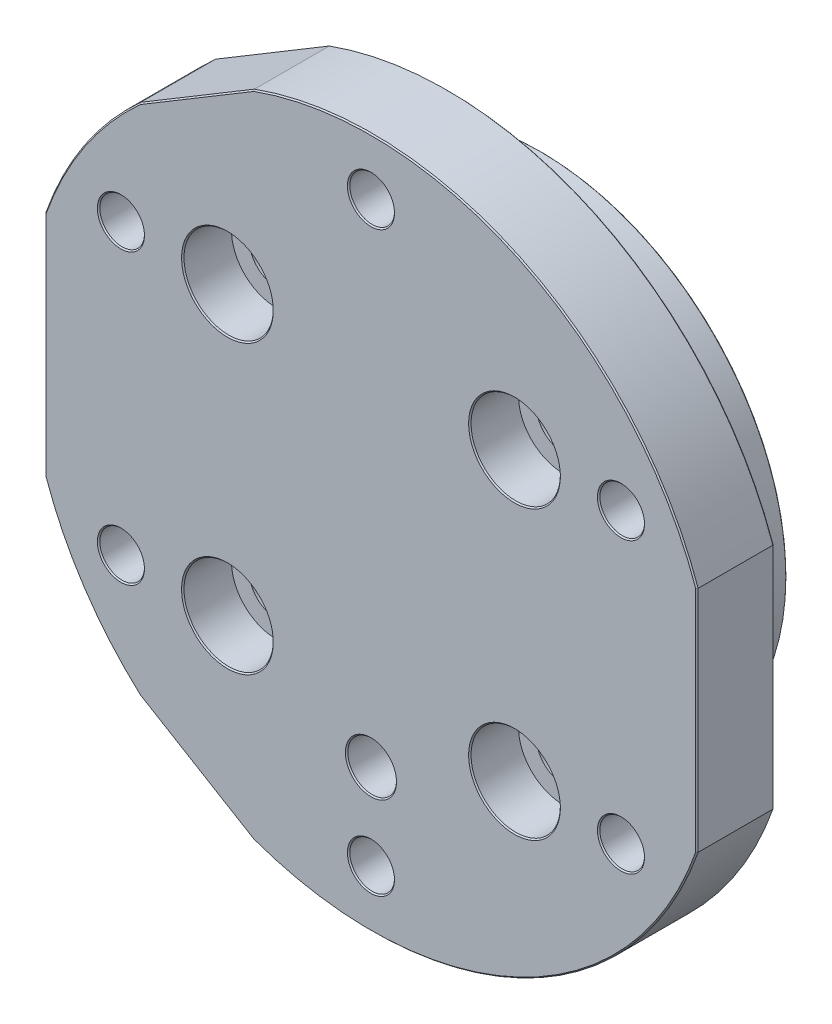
ISO-10303-21;
HEADER;
FILE_DESCRIPTION(('STEP AP214'),'2;1');
FILE_NAME('part.step','',(''),(''),'','','');
FILE_SCHEMA(('AUTOMOTIVE_DESIGN { 1 0 10303 214 1 1 1 1 }'));
ENDSEC;
DATA;
#1=APPLICATION_CONTEXT('core data for automotive mechanical design processes');
#2=APPLICATION_PROTOCOL_DEFINITION('international standard','automotive_design',2000,#1);
#3=PRODUCT_CONTEXT('',#1,'mechanical');
#4=PRODUCT('Part','Part','',(#3));
#5=PRODUCT_RELATED_PRODUCT_CATEGORY('part','',(#4));
#6=PRODUCT_DEFINITION_FORMATION('','',#4);
#7=PRODUCT_DEFINITION_CONTEXT('part definition',#1,'design');
#8=PRODUCT_DEFINITION('design','',#6,#7);
#9=PRODUCT_DEFINITION_SHAPE('','',#8);
#10=(LENGTH_UNIT() NAMED_UNIT(*) SI_UNIT(.MILLI.,.METRE.));
#11=(NAMED_UNIT(*) PLANE_ANGLE_UNIT() SI_UNIT($,.RADIAN.));
#12=(NAMED_UNIT(*) SI_UNIT($,.STERADIAN.) SOLID_ANGLE_UNIT());
#13=UNCERTAINTY_MEASURE_WITH_UNIT(LENGTH_MEASURE(1.E-05),#10,'distance_accuracy_value','');
#14=(GEOMETRIC_REPRESENTATION_CONTEXT(3) GLOBAL_UNCERTAINTY_ASSIGNED_CONTEXT((#13)) GLOBAL_UNIT_ASSIGNED_CONTEXT((#10,
#11,#12)) REPRESENTATION_CONTEXT('',''));
#15=CARTESIAN_POINT('',(0.,0.,0.));
#16=DIRECTION('',(0.,0.,1.));
#17=DIRECTION('',(1.,0.,0.));
#18=AXIS2_PLACEMENT_3D('',#15,#16,#17);
#19=CARTESIAN_POINT('',(0.,0.,0.));
#20=DIRECTION('',(0.,0.,-1.));
#21=DIRECTION('',(-1.,0.,0.));
#22=AXIS2_PLACEMENT_3D('',#19,#20,#21);
#23=PLANE('',#22);
#24=CARTESIAN_POINT('',(0.,-25.,0.));
#25=DIRECTION('',(0.,0.,-1.));
#26=DIRECTION('',(-1.,0.,0.));
#27=AXIS2_PLACEMENT_3D('',#24,#25,#26);
#28=CIRCLE('',#27,3.14999999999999);
#29=CARTESIAN_POINT('',(-3.14999999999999,-25.,0.));
#30=VERTEX_POINT('',#29);
#31=EDGE_CURVE('E185',#30,#30,#28,.T.);
#32=ORIENTED_EDGE('',*,*,#31,.T.);
#33=EDGE_LOOP('',(#32));
#34=FACE_BOUND('',#33,.T.);
#35=DIRECTION('',(0.,1.,0.));
#36=VECTOR('',#35,1.);
#37=CARTESIAN_POINT('',(40.0021038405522,0.,0.));
#38=LINE('',#37,#36);
#39=CARTESIAN_POINT('',(40.0021038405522,-14.0567310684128,0.));
#40=VERTEX_POINT('',#39);
#41=CARTESIAN_POINT('',(40.0021038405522,14.0567310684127,0.));
#42=VERTEX_POINT('',#41);
#43=EDGE_CURVE('E184',#40,#42,#38,.T.);
#44=ORIENTED_EDGE('',*,*,#43,.T.);
#45=CARTESIAN_POINT('',(0.,0.,0.));
#46=DIRECTION('',(0.,0.,-1.));
#47=DIRECTION('',(-1.,0.,0.));
#48=AXIS2_PLACEMENT_3D('',#45,#46,#47);
#49=CIRCLE('',#48,42.4);
#50=CARTESIAN_POINT('',(-14.4193277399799,39.8728352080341,0.));
#51=VERTEX_POINT('',#50);
#52=EDGE_CURVE('E163',#42,#51,#49,.F.);
#53=ORIENTED_EDGE('',*,*,#52,.T.);
#54=DIRECTION('',(-0.857425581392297,-0.514607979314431,0.));
#55=VECTOR('',#54,1.);
#56=CARTESIAN_POINT('',(-21.4119580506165,35.6760122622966,0.));
#57=LINE('',#56,#55);
#58=CARTESIAN_POINT('',(-28.4045883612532,31.479189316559,0.));
#59=VERTEX_POINT('',#58);
#60=EDGE_CURVE('E173',#51,#59,#57,.T.);
#61=ORIENTED_EDGE('',*,*,#60,.T.);
#62=CARTESIAN_POINT('',(0.,0.,0.));
#63=DIRECTION('',(0.,0.,-1.));
#64=DIRECTION('',(-1.,0.,0.));
#65=AXIS2_PLACEMENT_3D('',#62,#63,#64);
#66=CIRCLE('',#65,42.4);
#67=CARTESIAN_POINT('',(-40.0021038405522,14.0567310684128,0.));
#68=VERTEX_POINT('',#67);
#69=EDGE_CURVE('E179',#59,#68,#66,.F.);
#70=ORIENTED_EDGE('',*,*,#69,.T.);
#71=DIRECTION('',(0.,-1.,0.));
#72=VECTOR('',#71,1.);
#73=CARTESIAN_POINT('',(-40.0021038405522,0.,0.));
#74=LINE('',#73,#72);
#75=CARTESIAN_POINT('',(-40.0021038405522,-14.0567310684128,0.));
#76=VERTEX_POINT('',#75);
#77=EDGE_CURVE('E693',#68,#76,#74,.T.);
#78=ORIENTED_EDGE('',*,*,#77,.T.);
#79=CARTESIAN_POINT('',(0.,0.,0.));
#80=DIRECTION('',(0.,0.,-1.));
#81=DIRECTION('',(-1.,0.,0.));
#82=AXIS2_PLACEMENT_3D('',#79,#80,#81);
#83=CIRCLE('',#82,42.4);
#84=CARTESIAN_POINT('',(-28.4045883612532,-31.479189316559,0.));
#85=VERTEX_POINT('',#84);
#86=EDGE_CURVE('E695',#76,#85,#83,.F.);
#87=ORIENTED_EDGE('',*,*,#86,.T.);
#88=DIRECTION('',(0.857425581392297,-0.514607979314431,0.));
#89=VECTOR('',#88,1.);
#90=CARTESIAN_POINT('',(-21.4119580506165,-35.6760122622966,0.));
#91=LINE('',#90,#89);
#92=CARTESIAN_POINT('',(-14.4193277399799,-39.8728352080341,0.));
#93=VERTEX_POINT('',#92);
#94=EDGE_CURVE('E697',#85,#93,#91,.T.);
#95=ORIENTED_EDGE('',*,*,#94,.T.);
#96=CARTESIAN_POINT('',(0.,0.,0.));
#97=DIRECTION('',(0.,0.,-1.));
#98=DIRECTION('',(-1.,0.,0.));
#99=AXIS2_PLACEMENT_3D('',#96,#97,#98);
#100=CIRCLE('',#99,42.4);
#101=EDGE_CURVE('E190',#93,#40,#100,.F.);
#102=ORIENTED_EDGE('',*,*,#101,.T.);
#103=EDGE_LOOP('',(#44,#53,#61,#70,#78,#87,#95,#102));
#104=FACE_BOUND('',#103,.T.);
#105=CARTESIAN_POINT('',(-30.7958633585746,-17.7800000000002,0.));
#106=DIRECTION('',(0.,0.,-1.));
#107=DIRECTION('',(-1.,0.,0.));
#108=AXIS2_PLACEMENT_3D('',#105,#106,#107);
#109=CIRCLE('',#108,2.90000000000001);
#110=CARTESIAN_POINT('',(-33.6958633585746,-17.7800000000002,0.));
#111=VERTEX_POINT('',#110);
#112=EDGE_CURVE('E180',#111,#111,#109,.T.);
#113=ORIENTED_EDGE('',*,*,#112,.T.);
#114=EDGE_LOOP('',(#113));
#115=FACE_BOUND('',#114,.T.);
#116=CARTESIAN_POINT('',(-30.7958633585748,17.7799999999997,0.));
#117=DIRECTION('',(0.,0.,-1.));
#118=DIRECTION('',(-1.,0.,0.));
#119=AXIS2_PLACEMENT_3D('',#116,#117,#118);
#120=CIRCLE('',#119,2.90000000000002);
#121=CARTESIAN_POINT('',(-33.6958633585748,17.7799999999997,0.));
#122=VERTEX_POINT('',#121);
#123=EDGE_CURVE('E687',#122,#122,#120,.T.);
#124=ORIENTED_EDGE('',*,*,#123,.T.);
#125=EDGE_LOOP('',(#124));
#126=FACE_BOUND('',#125,.T.);
#127=CARTESIAN_POINT('',(0.,35.56,0.));
#128=DIRECTION('',(0.,0.,-1.));
#129=DIRECTION('',(-1.,0.,0.));
#130=AXIS2_PLACEMENT_3D('',#127,#128,#129);
#131=CIRCLE('',#130,2.9);
#132=CARTESIAN_POINT('',(-2.9,35.56,0.));
#133=VERTEX_POINT('',#132);
#134=EDGE_CURVE('E684',#133,#133,#131,.T.);
#135=ORIENTED_EDGE('',*,*,#134,.T.);
#136=EDGE_LOOP('',(#135));
#137=FACE_BOUND('',#136,.T.);
#138=CARTESIAN_POINT('',(30.7958633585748,17.7799999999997,0.));
#139=DIRECTION('',(0.,0.,-1.));
#140=DIRECTION('',(-1.,0.,0.));
#141=AXIS2_PLACEMENT_3D('',#138,#139,#140);
#142=CIRCLE('',#141,2.90000000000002);
#143=CARTESIAN_POINT('',(27.8958633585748,17.7799999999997,0.));
#144=VERTEX_POINT('',#143);
#145=EDGE_CURVE('E681',#144,#144,#142,.T.);
#146=ORIENTED_EDGE('',*,*,#145,.T.);
#147=EDGE_LOOP('',(#146));
#148=FACE_BOUND('',#147,.T.);
#149=CARTESIAN_POINT('',(30.7958633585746,-17.7800000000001,0.));
#150=DIRECTION('',(0.,0.,-1.));
#151=DIRECTION('',(-1.,0.,0.));
#152=AXIS2_PLACEMENT_3D('',#149,#150,#151);
#153=CIRCLE('',#152,2.90000000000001);
#154=CARTESIAN_POINT('',(27.8958633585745,-17.7800000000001,0.));
#155=VERTEX_POINT('',#154);
#156=EDGE_CURVE('E678',#155,#155,#153,.T.);
#157=ORIENTED_EDGE('',*,*,#156,.T.);
#158=EDGE_LOOP('',(#157));
#159=FACE_BOUND('',#158,.T.);
#160=CARTESIAN_POINT('',(0.,-35.56,0.));
#161=DIRECTION('',(0.,0.,-1.));
#162=DIRECTION('',(-1.,0.,0.));
#163=AXIS2_PLACEMENT_3D('',#160,#161,#162);
#164=CIRCLE('',#163,2.9);
#165=CARTESIAN_POINT('',(-2.90000000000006,-35.56,0.));
#166=VERTEX_POINT('',#165);
#167=EDGE_CURVE('E675',#166,#166,#164,.T.);
#168=ORIENTED_EDGE('',*,*,#167,.T.);
#169=EDGE_LOOP('',(#168));
#170=FACE_BOUND('',#169,.T.);
#171=CARTESIAN_POINT('',(-17.6776695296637,17.6776695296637,0.));
#172=DIRECTION('',(0.,0.,-1.));
#173=DIRECTION('',(-1.,0.,0.));
#174=AXIS2_PLACEMENT_3D('',#171,#172,#173);
#175=CIRCLE('',#174,5.65000000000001);
#176=CARTESIAN_POINT('',(-23.3276695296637,17.6776695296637,0.));
#177=VERTEX_POINT('',#176);
#178=EDGE_CURVE('E672',#177,#177,#175,.T.);
#179=ORIENTED_EDGE('',*,*,#178,.T.);
#180=EDGE_LOOP('',(#179));
#181=FACE_BOUND('',#180,.T.);
#182=CARTESIAN_POINT('',(17.6776695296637,17.6776695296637,0.));
#183=DIRECTION('',(0.,0.,-1.));
#184=DIRECTION('',(-1.,0.,0.));
#185=AXIS2_PLACEMENT_3D('',#182,#183,#184);
#186=CIRCLE('',#185,5.65);
#187=CARTESIAN_POINT('',(12.0276695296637,17.6776695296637,0.));
#188=VERTEX_POINT('',#187);
#189=EDGE_CURVE('E669',#188,#188,#186,.T.);
#190=ORIENTED_EDGE('',*,*,#189,.T.);
#191=EDGE_LOOP('',(#190));
#192=FACE_BOUND('',#191,.T.);
#193=CARTESIAN_POINT('',(17.6776695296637,-17.6776695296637,0.));
#194=DIRECTION('',(0.,0.,-1.));
#195=DIRECTION('',(-1.,0.,0.));
#196=AXIS2_PLACEMENT_3D('',#193,#194,#195);
#197=CIRCLE('',#196,5.65);
#198=CARTESIAN_POINT('',(12.0276695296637,-17.6776695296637,0.));
#199=VERTEX_POINT('',#198);
#200=EDGE_CURVE('E660',#199,#199,#197,.T.);
#201=ORIENTED_EDGE('',*,*,#200,.T.);
#202=EDGE_LOOP('',(#201));
#203=FACE_BOUND('',#202,.T.);
#204=CARTESIAN_POINT('',(-17.6776695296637,-17.6776695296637,0.));
#205=DIRECTION('',(0.,0.,-1.));
#206=DIRECTION('',(-1.,0.,0.));
#207=AXIS2_PLACEMENT_3D('',#204,#205,#206);
#208=CIRCLE('',#207,5.65);
#209=CARTESIAN_POINT('',(-23.3276695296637,-17.6776695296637,0.));
#210=VERTEX_POINT('',#209);
#211=EDGE_CURVE('E656',#210,#210,#208,.T.);
#212=ORIENTED_EDGE('',*,*,#211,.T.);
#213=EDGE_LOOP('',(#212));
#214=FACE_BOUND('',#213,.T.);
#215=ADVANCED_FACE('F36',(#34,#104,#115,#126,#137,#148,#159,#170,#181,#192,#203,#214),#23,.F.);
#216=CARTESIAN_POINT('',(-28.4942540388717,31.6003162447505,-9.5));
#217=DIRECTION('',(0.514607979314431,-0.857425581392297,0.));
#218=DIRECTION('',(0.857425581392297,0.514607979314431,0.));
#219=AXIS2_PLACEMENT_3D('',#216,#217,#218);
#220=PLANE('',#219);
#221=DIRECTION('',(0.,0.,1.));
#222=VECTOR('',#221,1.);
#223=CARTESIAN_POINT('',(-28.4942540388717,31.6003162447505,-9.5));
#224=LINE('',#223,#222);
#225=CARTESIAN_POINT('',(-28.4942540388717,31.6003162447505,-9.34999999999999));
#226=VERTEX_POINT('',#225);
#227=CARTESIAN_POINT('',(-28.4942540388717,31.6003162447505,-0.149999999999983));
#228=VERTEX_POINT('',#227);
#229=EDGE_CURVE('E733',#226,#228,#224,.T.);
#230=ORIENTED_EDGE('',*,*,#229,.T.);
#231=DIRECTION('',(0.857425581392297,0.514607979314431,0.));
#232=VECTOR('',#231,1.);
#233=CARTESIAN_POINT('',(-28.4942540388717,31.6003162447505,-0.149999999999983));
#234=LINE('',#233,#232);
#235=CARTESIAN_POINT('',(-14.4840444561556,40.0089359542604,-0.149999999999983));
#236=VERTEX_POINT('',#235);
#237=EDGE_CURVE('E223',#228,#236,#234,.T.);
#238=ORIENTED_EDGE('',*,*,#237,.T.);
#239=DIRECTION('',(0.,0.,1.));
#240=VECTOR('',#239,1.);
#241=CARTESIAN_POINT('',(-14.4840444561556,40.0089359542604,-9.5));
#242=LINE('',#241,#240);
#243=CARTESIAN_POINT('',(-14.4840444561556,40.0089359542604,-9.34999999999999));
#244=VERTEX_POINT('',#243);
#245=EDGE_CURVE('E663',#244,#236,#242,.T.);
#246=ORIENTED_EDGE('',*,*,#245,.F.);
#247=DIRECTION('',(-0.857425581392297,-0.514607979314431,0.));
#248=VECTOR('',#247,1.);
#249=CARTESIAN_POINT('',(-28.4942540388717,31.6003162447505,-9.34999999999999));
#250=LINE('',#249,#248);
#251=EDGE_CURVE('E221',#244,#226,#250,.T.);
#252=ORIENTED_EDGE('',*,*,#251,.T.);
#253=EDGE_LOOP('',(#230,#238,#246,#252));
#254=FACE_BOUND('',#253,.T.);
#255=ADVANCED_FACE('F597',(#254),#220,.F.);
#256=CARTESIAN_POINT('',(0.,0.,-9.5));
#257=DIRECTION('',(0.,0.,1.));
#258=DIRECTION('',(1.,0.,0.));
#259=AXIS2_PLACEMENT_3D('',#256,#257,#258);
#260=CYLINDRICAL_SURFACE('',#259,42.55);
#261=ORIENTED_EDGE('',*,*,#245,.T.);
#262=CARTESIAN_POINT('',(0.,0.,-0.149999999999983));
#263=DIRECTION('',(0.,0.,-1.));
#264=DIRECTION('',(-1.,0.,0.));
#265=AXIS2_PLACEMENT_3D('',#262,#263,#264);
#266=CIRCLE('',#265,42.55);
#267=CARTESIAN_POINT('',(40.1521038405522,14.0822958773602,-0.149999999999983));
#268=VERTEX_POINT('',#267);
#269=EDGE_CURVE('E166',#236,#268,#266,.T.);
#270=ORIENTED_EDGE('',*,*,#269,.T.);
#271=DIRECTION('',(0.,0.,1.));
#272=VECTOR('',#271,1.);
#273=CARTESIAN_POINT('',(40.1521038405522,14.0822958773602,-9.5));
#274=LINE('',#273,#272);
#275=CARTESIAN_POINT('',(40.1521038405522,14.0822958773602,-9.34999999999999));
#276=VERTEX_POINT('',#275);
#277=EDGE_CURVE('E713',#276,#268,#274,.T.);
#278=ORIENTED_EDGE('',*,*,#277,.F.);
#279=CARTESIAN_POINT('',(0.,0.,-9.34999999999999));
#280=DIRECTION('',(0.,0.,-1.));
#281=DIRECTION('',(-1.,0.,0.));
#282=AXIS2_PLACEMENT_3D('',#279,#280,#281);
#283=CIRCLE('',#282,42.55);
#284=EDGE_CURVE('E188',#276,#244,#283,.F.);
#285=ORIENTED_EDGE('',*,*,#284,.T.);
#286=EDGE_LOOP('',(#261,#270,#278,#285));
#287=FACE_BOUND('',#286,.T.);
#288=ADVANCED_FACE('F603',(#287),#260,.T.);
#289=CARTESIAN_POINT('',(40.1521038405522,14.0822958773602,-9.5));
#290=DIRECTION('',(-1.,0.,0.));
#291=DIRECTION('',(0.,0.,1.));
#292=AXIS2_PLACEMENT_3D('',#289,#290,#291);
#293=PLANE('',#292);
#294=ORIENTED_EDGE('',*,*,#277,.T.);
#295=DIRECTION('',(0.,-1.,0.));
#296=VECTOR('',#295,1.);
#297=CARTESIAN_POINT('',(40.1521038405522,14.0822958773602,-0.149999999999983));
#298=LINE('',#297,#296);
#299=CARTESIAN_POINT('',(40.1521038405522,-14.0822958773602,-0.149999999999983));
#300=VERTEX_POINT('',#299);
#301=EDGE_CURVE('E198',#268,#300,#298,.T.);
#302=ORIENTED_EDGE('',*,*,#301,.T.);
#303=DIRECTION('',(0.,0.,1.));
#304=VECTOR('',#303,1.);
#305=CARTESIAN_POINT('',(40.1521038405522,-14.0822958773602,-9.5));
#306=LINE('',#305,#304);
#307=CARTESIAN_POINT('',(40.1521038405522,-14.0822958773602,-9.34999999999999));
#308=VERTEX_POINT('',#307);
#309=EDGE_CURVE('E717',#308,#300,#306,.T.);
#310=ORIENTED_EDGE('',*,*,#309,.F.);
#311=DIRECTION('',(0.,1.,0.));
#312=VECTOR('',#311,1.);
#313=CARTESIAN_POINT('',(40.1521038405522,14.0822958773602,-9.34999999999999));
#314=LINE('',#313,#312);
#315=EDGE_CURVE('E196',#308,#276,#314,.T.);
#316=ORIENTED_EDGE('',*,*,#315,.T.);
#317=EDGE_LOOP('',(#294,#302,#310,#316));
#318=FACE_BOUND('',#317,.T.);
#319=ADVANCED_FACE('F629',(#318),#293,.F.);
#320=CARTESIAN_POINT('',(0.,0.,-9.5));
#321=DIRECTION('',(0.,0.,1.));
#322=DIRECTION('',(1.,0.,0.));
#323=AXIS2_PLACEMENT_3D('',#320,#321,#322);
#324=CYLINDRICAL_SURFACE('',#323,42.55);
#325=ORIENTED_EDGE('',*,*,#309,.T.);
#326=CARTESIAN_POINT('',(0.,0.,-0.149999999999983));
#327=DIRECTION('',(0.,0.,-1.));
#328=DIRECTION('',(-1.,0.,0.));
#329=AXIS2_PLACEMENT_3D('',#326,#327,#328);
#330=CIRCLE('',#329,42.55);
#331=CARTESIAN_POINT('',(-14.4840444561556,-40.0089359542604,-0.149999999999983));
#332=VERTEX_POINT('',#331);
#333=EDGE_CURVE('E202',#300,#332,#330,.T.);
#334=ORIENTED_EDGE('',*,*,#333,.T.);
#335=DIRECTION('',(0.,0.,1.));
#336=VECTOR('',#335,1.);
#337=CARTESIAN_POINT('',(-14.4840444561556,-40.0089359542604,-9.5));
#338=LINE('',#337,#336);
#339=CARTESIAN_POINT('',(-14.4840444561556,-40.0089359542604,-9.34999999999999));
#340=VERTEX_POINT('',#339);
#341=EDGE_CURVE('E719',#340,#332,#338,.T.);
#342=ORIENTED_EDGE('',*,*,#341,.F.);
#343=CARTESIAN_POINT('',(0.,0.,-9.34999999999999));
#344=DIRECTION('',(0.,0.,-1.));
#345=DIRECTION('',(-1.,0.,0.));
#346=AXIS2_PLACEMENT_3D('',#343,#344,#345);
#347=CIRCLE('',#346,42.55);
#348=EDGE_CURVE('E200',#340,#308,#347,.F.);
#349=ORIENTED_EDGE('',*,*,#348,.T.);
#350=EDGE_LOOP('',(#325,#334,#342,#349));
#351=FACE_BOUND('',#350,.T.);
#352=ADVANCED_FACE('F625',(#351),#324,.T.);
#353=CARTESIAN_POINT('',(-14.4840444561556,-40.0089359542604,-9.5));
#354=DIRECTION('',(0.514607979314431,0.857425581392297,0.));
#355=DIRECTION('',(-0.857425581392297,0.514607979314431,0.));
#356=AXIS2_PLACEMENT_3D('',#353,#354,#355);
#357=PLANE('',#356);
#358=ORIENTED_EDGE('',*,*,#341,.T.);
#359=DIRECTION('',(-0.857425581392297,0.514607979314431,0.));
#360=VECTOR('',#359,1.);
#361=CARTESIAN_POINT('',(-14.4840444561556,-40.0089359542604,-0.149999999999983));
#362=LINE('',#361,#360);
#363=CARTESIAN_POINT('',(-28.4942540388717,-31.6003162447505,-0.149999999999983));
#364=VERTEX_POINT('',#363);
#365=EDGE_CURVE('E206',#332,#364,#362,.T.);
#366=ORIENTED_EDGE('',*,*,#365,.T.);
#367=DIRECTION('',(0.,0.,1.));
#368=VECTOR('',#367,1.);
#369=CARTESIAN_POINT('',(-28.4942540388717,-31.6003162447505,-9.5));
#370=LINE('',#369,#368);
#371=CARTESIAN_POINT('',(-28.4942540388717,-31.6003162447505,-9.34999999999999));
#372=VERTEX_POINT('',#371);
#373=EDGE_CURVE('E724',#372,#364,#370,.T.);
#374=ORIENTED_EDGE('',*,*,#373,.F.);
#375=DIRECTION('',(0.857425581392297,-0.514607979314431,0.));
#376=VECTOR('',#375,1.);
#377=CARTESIAN_POINT('',(-14.4840444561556,-40.0089359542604,-9.34999999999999));
#378=LINE('',#377,#376);
#379=EDGE_CURVE('E204',#372,#340,#378,.T.);
#380=ORIENTED_EDGE('',*,*,#379,.T.);
#381=EDGE_LOOP('',(#358,#366,#374,#380));
#382=FACE_BOUND('',#381,.T.);
#383=ADVANCED_FACE('F621',(#382),#357,.F.);
#384=CARTESIAN_POINT('',(0.,0.,-9.5));
#385=DIRECTION('',(0.,0.,1.));
#386=DIRECTION('',(1.,0.,0.));
#387=AXIS2_PLACEMENT_3D('',#384,#385,#386);
#388=CYLINDRICAL_SURFACE('',#387,42.55);
#389=ORIENTED_EDGE('',*,*,#373,.T.);
#390=CARTESIAN_POINT('',(0.,0.,-0.149999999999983));
#391=DIRECTION('',(0.,0.,-1.));
#392=DIRECTION('',(-1.,0.,0.));
#393=AXIS2_PLACEMENT_3D('',#390,#391,#392);
#394=CIRCLE('',#393,42.55);
#395=CARTESIAN_POINT('',(-40.1521038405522,-14.0822958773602,-0.149999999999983));
#396=VERTEX_POINT('',#395);
#397=EDGE_CURVE('E210',#364,#396,#394,.T.);
#398=ORIENTED_EDGE('',*,*,#397,.T.);
#399=DIRECTION('',(0.,0.,1.));
#400=VECTOR('',#399,1.);
#401=CARTESIAN_POINT('',(-40.1521038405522,-14.0822958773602,-9.5));
#402=LINE('',#401,#400);
#403=CARTESIAN_POINT('',(-40.1521038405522,-14.0822958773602,-9.34999999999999));
#404=VERTEX_POINT('',#403);
#405=EDGE_CURVE('E727',#404,#396,#402,.T.);
#406=ORIENTED_EDGE('',*,*,#405,.F.);
#407=CARTESIAN_POINT('',(0.,0.,-9.34999999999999));
#408=DIRECTION('',(0.,0.,-1.));
#409=DIRECTION('',(-1.,0.,0.));
#410=AXIS2_PLACEMENT_3D('',#407,#408,#409);
#411=CIRCLE('',#410,42.55);
#412=EDGE_CURVE('E208',#404,#372,#411,.F.);
#413=ORIENTED_EDGE('',*,*,#412,.T.);
#414=EDGE_LOOP('',(#389,#398,#406,#413));
#415=FACE_BOUND('',#414,.T.);
#416=ADVANCED_FACE('F617',(#415),#388,.T.);
#417=CARTESIAN_POINT('',(-40.1521038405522,-14.0822958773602,-9.5));
#418=DIRECTION('',(1.,0.,0.));
#419=DIRECTION('',(0.,0.,-1.));
#420=AXIS2_PLACEMENT_3D('',#417,#418,#419);
#421=PLANE('',#420);
#422=ORIENTED_EDGE('',*,*,#405,.T.);
#423=DIRECTION('',(0.,1.,0.));
#424=VECTOR('',#423,1.);
#425=CARTESIAN_POINT('',(-40.1521038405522,-14.0822958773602,-0.149999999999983));
#426=LINE('',#425,#424);
#427=CARTESIAN_POINT('',(-40.1521038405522,14.0822958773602,-0.149999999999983));
#428=VERTEX_POINT('',#427);
#429=EDGE_CURVE('E214',#396,#428,#426,.T.);
#430=ORIENTED_EDGE('',*,*,#429,.T.);
#431=DIRECTION('',(0.,0.,1.));
#432=VECTOR('',#431,1.);
#433=CARTESIAN_POINT('',(-40.1521038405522,14.0822958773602,-9.5));
#434=LINE('',#433,#432);
#435=CARTESIAN_POINT('',(-40.1521038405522,14.0822958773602,-9.34999999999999));
#436=VERTEX_POINT('',#435);
#437=EDGE_CURVE('E730',#436,#428,#434,.T.);
#438=ORIENTED_EDGE('',*,*,#437,.F.);
#439=DIRECTION('',(0.,-1.,0.));
#440=VECTOR('',#439,1.);
#441=CARTESIAN_POINT('',(-40.1521038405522,-14.0822958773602,-9.34999999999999));
#442=LINE('',#441,#440);
#443=EDGE_CURVE('E212',#436,#404,#442,.T.);
#444=ORIENTED_EDGE('',*,*,#443,.T.);
#445=EDGE_LOOP('',(#422,#430,#438,#444));
#446=FACE_BOUND('',#445,.T.);
#447=ADVANCED_FACE('F613',(#446),#421,.F.);
#448=CARTESIAN_POINT('',(0.,0.,-9.5));
#449=DIRECTION('',(0.,0.,1.));
#450=DIRECTION('',(1.,0.,0.));
#451=AXIS2_PLACEMENT_3D('',#448,#449,#450);
#452=CYLINDRICAL_SURFACE('',#451,42.55);
#453=ORIENTED_EDGE('',*,*,#437,.T.);
#454=CARTESIAN_POINT('',(0.,0.,-0.149999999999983));
#455=DIRECTION('',(0.,0.,-1.));
#456=DIRECTION('',(-1.,0.,0.));
#457=AXIS2_PLACEMENT_3D('',#454,#455,#456);
#458=CIRCLE('',#457,42.55);
#459=EDGE_CURVE('E219',#428,#228,#458,.T.);
#460=ORIENTED_EDGE('',*,*,#459,.T.);
#461=ORIENTED_EDGE('',*,*,#229,.F.);
#462=CARTESIAN_POINT('',(0.,0.,-9.34999999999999));
#463=DIRECTION('',(0.,0.,-1.));
#464=DIRECTION('',(-1.,0.,0.));
#465=AXIS2_PLACEMENT_3D('',#462,#463,#464);
#466=CIRCLE('',#465,42.55);
#467=EDGE_CURVE('E216',#226,#436,#466,.F.);
#468=ORIENTED_EDGE('',*,*,#467,.T.);
#469=EDGE_LOOP('',(#453,#460,#461,#468));
#470=FACE_BOUND('',#469,.T.);
#471=ADVANCED_FACE('F610',(#470),#452,.T.);
#472=CARTESIAN_POINT('',(0.,0.,-9.5));
#473=DIRECTION('',(0.,0.,-1.));
#474=DIRECTION('',(-1.,0.,0.));
#475=AXIS2_PLACEMENT_3D('',#472,#473,#474);
#476=PLANE('',#475);
#477=DIRECTION('',(0.,1.,0.));
#478=VECTOR('',#477,1.);
#479=CARTESIAN_POINT('',(-40.0021038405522,14.0822958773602,-9.5));
#480=LINE('',#479,#478);
#481=CARTESIAN_POINT('',(-40.0021038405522,-14.0567310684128,-9.5));
#482=VERTEX_POINT('',#481);
#483=CARTESIAN_POINT('',(-40.0021038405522,14.0567310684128,-9.5));
#484=VERTEX_POINT('',#483);
#485=EDGE_CURVE('E60',#482,#484,#480,.T.);
#486=ORIENTED_EDGE('',*,*,#485,.T.);
#487=CARTESIAN_POINT('',(0.,0.,-9.5));
#488=DIRECTION('',(0.,0.,-1.));
#489=DIRECTION('',(-1.,0.,0.));
#490=AXIS2_PLACEMENT_3D('',#487,#488,#489);
#491=CIRCLE('',#490,42.4);
#492=CARTESIAN_POINT('',(-28.4045883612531,31.479189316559,-9.5));
#493=VERTEX_POINT('',#492);
#494=EDGE_CURVE('E336',#484,#493,#491,.T.);
#495=ORIENTED_EDGE('',*,*,#494,.T.);
#496=DIRECTION('',(0.857425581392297,0.514607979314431,0.));
#497=VECTOR('',#496,1.);
#498=CARTESIAN_POINT('',(-14.4068532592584,39.8803221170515,-9.5));
#499=LINE('',#498,#497);
#500=CARTESIAN_POINT('',(-14.4193277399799,39.8728352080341,-9.5));
#501=VERTEX_POINT('',#500);
#502=EDGE_CURVE('E324',#493,#501,#499,.T.);
#503=ORIENTED_EDGE('',*,*,#502,.T.);
#504=CARTESIAN_POINT('',(0.,0.,-9.5));
#505=DIRECTION('',(0.,0.,-1.));
#506=DIRECTION('',(-1.,0.,0.));
#507=AXIS2_PLACEMENT_3D('',#504,#505,#506);
#508=CIRCLE('',#507,42.4);
#509=CARTESIAN_POINT('',(40.0021038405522,14.0567310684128,-9.5));
#510=VERTEX_POINT('',#509);
#511=EDGE_CURVE('E326',#501,#510,#508,.T.);
#512=ORIENTED_EDGE('',*,*,#511,.T.);
#513=DIRECTION('',(0.,-1.,0.));
#514=VECTOR('',#513,1.);
#515=CARTESIAN_POINT('',(40.0021038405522,-14.0822958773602,-9.5));
#516=LINE('',#515,#514);
#517=CARTESIAN_POINT('',(40.0021038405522,-14.0567310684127,-9.5));
#518=VERTEX_POINT('',#517);
#519=EDGE_CURVE('E328',#510,#518,#516,.T.);
#520=ORIENTED_EDGE('',*,*,#519,.T.);
#521=CARTESIAN_POINT('',(0.,0.,-9.5));
#522=DIRECTION('',(0.,0.,-1.));
#523=DIRECTION('',(-1.,0.,0.));
#524=AXIS2_PLACEMENT_3D('',#521,#522,#523);
#525=CIRCLE('',#524,42.4);
#526=CARTESIAN_POINT('',(-14.4193277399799,-39.8728352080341,-9.5));
#527=VERTEX_POINT('',#526);
#528=EDGE_CURVE('E330',#518,#527,#525,.T.);
#529=ORIENTED_EDGE('',*,*,#528,.T.);
#530=DIRECTION('',(-0.857425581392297,0.514607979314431,0.));
#531=VECTOR('',#530,1.);
#532=CARTESIAN_POINT('',(-28.4170628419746,-31.4717024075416,-9.5));
#533=LINE('',#532,#531);
#534=CARTESIAN_POINT('',(-28.4045883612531,-31.479189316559,-9.5));
#535=VERTEX_POINT('',#534);
#536=EDGE_CURVE('E332',#527,#535,#533,.T.);
#537=ORIENTED_EDGE('',*,*,#536,.T.);
#538=CARTESIAN_POINT('',(0.,0.,-9.5));
#539=DIRECTION('',(0.,0.,-1.));
#540=DIRECTION('',(-1.,0.,0.));
#541=AXIS2_PLACEMENT_3D('',#538,#539,#540);
#542=CIRCLE('',#541,42.4);
#543=EDGE_CURVE('E65',#535,#482,#542,.T.);
#544=ORIENTED_EDGE('',*,*,#543,.T.);
#545=EDGE_LOOP('',(#486,#495,#503,#512,#520,#529,#537,#544));
#546=FACE_BOUND('',#545,.T.);
#547=CARTESIAN_POINT('',(0.,0.,-9.5));
#548=DIRECTION('',(0.,0.,-1.));
#549=DIRECTION('',(-1.,0.,0.));
#550=AXIS2_PLACEMENT_3D('',#547,#548,#549);
#551=CIRCLE('',#550,30.4);
#552=CARTESIAN_POINT('',(-30.4,0.,-9.5));
#553=VERTEX_POINT('',#552);
#554=EDGE_CURVE('E321',#553,#553,#551,.F.);
#555=ORIENTED_EDGE('',*,*,#554,.T.);
#556=EDGE_LOOP('',(#555));
#557=FACE_BOUND('',#556,.T.);
#558=CARTESIAN_POINT('',(-30.7958633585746,-17.7800000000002,-9.5));
#559=DIRECTION('',(0.,0.,-1.));
#560=DIRECTION('',(-1.,0.,0.));
#561=AXIS2_PLACEMENT_3D('',#558,#559,#560);
#562=CIRCLE('',#561,5.14999999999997);
#563=CARTESIAN_POINT('',(-35.9458633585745,-17.7800000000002,-9.5));
#564=VERTEX_POINT('',#563);
#565=EDGE_CURVE('E318',#564,#564,#562,.F.);
#566=ORIENTED_EDGE('',*,*,#565,.T.);
#567=EDGE_LOOP('',(#566));
#568=FACE_BOUND('',#567,.T.);
#569=CARTESIAN_POINT('',(-30.7958633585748,17.7799999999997,-9.5));
#570=DIRECTION('',(0.,0.,-1.));
#571=DIRECTION('',(-1.,0.,0.));
#572=AXIS2_PLACEMENT_3D('',#569,#570,#571);
#573=CIRCLE('',#572,5.14999999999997);
#574=CARTESIAN_POINT('',(-35.9458633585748,17.7799999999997,-9.5));
#575=VERTEX_POINT('',#574);
#576=EDGE_CURVE('E315',#575,#575,#573,.F.);
#577=ORIENTED_EDGE('',*,*,#576,.T.);
#578=EDGE_LOOP('',(#577));
#579=FACE_BOUND('',#578,.T.);
#580=CARTESIAN_POINT('',(0.,35.56,-9.5));
#581=DIRECTION('',(0.,0.,-1.));
#582=DIRECTION('',(-1.,0.,0.));
#583=AXIS2_PLACEMENT_3D('',#580,#581,#582);
#584=CIRCLE('',#583,5.14999999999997);
#585=CARTESIAN_POINT('',(-5.14999999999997,35.56,-9.5));
#586=VERTEX_POINT('',#585);
#587=EDGE_CURVE('E312',#586,#586,#584,.F.);
#588=ORIENTED_EDGE('',*,*,#587,.T.);
#589=EDGE_LOOP('',(#588));
#590=FACE_BOUND('',#589,.T.);
#591=CARTESIAN_POINT('',(30.7958633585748,17.7799999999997,-9.5));
#592=DIRECTION('',(0.,0.,-1.));
#593=DIRECTION('',(-1.,0.,0.));
#594=AXIS2_PLACEMENT_3D('',#591,#592,#593);
#595=CIRCLE('',#594,5.14999999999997);
#596=CARTESIAN_POINT('',(25.6458633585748,17.7799999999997,-9.5));
#597=VERTEX_POINT('',#596);
#598=EDGE_CURVE('E309',#597,#597,#595,.F.);
#599=ORIENTED_EDGE('',*,*,#598,.T.);
#600=EDGE_LOOP('',(#599));
#601=FACE_BOUND('',#600,.T.);
#602=CARTESIAN_POINT('',(30.7958633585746,-17.7800000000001,-9.5));
#603=DIRECTION('',(0.,0.,-1.));
#604=DIRECTION('',(-1.,0.,0.));
#605=AXIS2_PLACEMENT_3D('',#602,#603,#604);
#606=CIRCLE('',#605,5.14999999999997);
#607=CARTESIAN_POINT('',(25.6458633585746,-17.7800000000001,-9.5));
#608=VERTEX_POINT('',#607);
#609=EDGE_CURVE('E306',#608,#608,#606,.F.);
#610=ORIENTED_EDGE('',*,*,#609,.T.);
#611=EDGE_LOOP('',(#610));
#612=FACE_BOUND('',#611,.T.);
#613=CARTESIAN_POINT('',(0.,-35.56,-9.5));
#614=DIRECTION('',(0.,0.,-1.));
#615=DIRECTION('',(-1.,0.,0.));
#616=AXIS2_PLACEMENT_3D('',#613,#614,#615);
#617=CIRCLE('',#616,5.14999999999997);
#618=CARTESIAN_POINT('',(-5.15000000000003,-35.56,-9.5));
#619=VERTEX_POINT('',#618);
#620=EDGE_CURVE('E303',#619,#619,#617,.F.);
#621=ORIENTED_EDGE('',*,*,#620,.T.);
#622=EDGE_LOOP('',(#621));
#623=FACE_BOUND('',#622,.T.);
#624=ADVANCED_FACE('F608',(#546,#557,#568,#579,#590,#601,#612,#623),#476,.T.);
#625=CARTESIAN_POINT('',(0.,0.,-21.));
#626=DIRECTION('',(0.,0.,1.));
#627=DIRECTION('',(1.,0.,0.));
#628=AXIS2_PLACEMENT_3D('',#625,#626,#627);
#629=CYLINDRICAL_SURFACE('',#628,30.25);
#630=CARTESIAN_POINT('',(0.,0.,-20.85));
#631=DIRECTION('',(0.,0.,-1.));
#632=DIRECTION('',(-1.,0.,0.));
#633=AXIS2_PLACEMENT_3D('',#630,#631,#632);
#634=CIRCLE('',#633,30.25);
#635=CARTESIAN_POINT('',(-30.25,0.,-20.85));
#636=VERTEX_POINT('',#635);
#637=EDGE_CURVE('E288',#636,#636,#634,.F.);
#638=ORIENTED_EDGE('',*,*,#637,.T.);
#639=EDGE_LOOP('',(#638));
#640=FACE_BOUND('',#639,.T.);
#641=CARTESIAN_POINT('',(0.,0.,-9.65000000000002));
#642=DIRECTION('',(0.,0.,-1.));
#643=DIRECTION('',(-1.,0.,0.));
#644=AXIS2_PLACEMENT_3D('',#641,#642,#643);
#645=CIRCLE('',#644,30.25);
#646=CARTESIAN_POINT('',(-30.25,0.,-9.65000000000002));
#647=VERTEX_POINT('',#646);
#648=EDGE_CURVE('E285',#647,#647,#645,.T.);
#649=ORIENTED_EDGE('',*,*,#648,.T.);
#650=EDGE_LOOP('',(#649));
#651=FACE_BOUND('',#650,.T.);
#652=ADVANCED_FACE('F929',(#640,#651),#629,.T.);
#653=CARTESIAN_POINT('',(0.,0.,-21.));
#654=DIRECTION('',(0.,0.,-1.));
#655=DIRECTION('',(-1.,0.,0.));
#656=AXIS2_PLACEMENT_3D('',#653,#654,#655);
#657=PLANE('',#656);
#658=CARTESIAN_POINT('',(0.,0.,-21.));
#659=DIRECTION('',(0.,0.,-1.));
#660=DIRECTION('',(-1.,0.,0.));
#661=AXIS2_PLACEMENT_3D('',#658,#659,#660);
#662=CIRCLE('',#661,30.1);
#663=CARTESIAN_POINT('',(-30.1,0.,-21.));
#664=VERTEX_POINT('',#663);
#665=EDGE_CURVE('E282',#664,#664,#662,.T.);
#666=ORIENTED_EDGE('',*,*,#665,.T.);
#667=EDGE_LOOP('',(#666));
#668=FACE_BOUND('',#667,.T.);
#669=CARTESIAN_POINT('',(0.,0.,-21.));
#670=DIRECTION('',(0.,0.,-1.));
#671=DIRECTION('',(-1.,0.,0.));
#672=AXIS2_PLACEMENT_3D('',#669,#670,#671);
#673=CIRCLE('',#672,15.9);
#674=CARTESIAN_POINT('',(-15.9,0.,-21.));
#675=VERTEX_POINT('',#674);
#676=EDGE_CURVE('E279',#675,#675,#673,.F.);
#677=ORIENTED_EDGE('',*,*,#676,.T.);
#678=EDGE_LOOP('',(#677));
#679=FACE_BOUND('',#678,.T.);
#680=CARTESIAN_POINT('',(-17.6776695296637,17.6776695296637,-21.));
#681=DIRECTION('',(0.,0.,-1.));
#682=DIRECTION('',(-1.,0.,0.));
#683=AXIS2_PLACEMENT_3D('',#680,#681,#682);
#684=CIRCLE('',#683,3.45000000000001);
#685=CARTESIAN_POINT('',(-21.1276695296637,17.6776695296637,-21.));
#686=VERTEX_POINT('',#685);
#687=EDGE_CURVE('E276',#686,#686,#684,.F.);
#688=ORIENTED_EDGE('',*,*,#687,.T.);
#689=EDGE_LOOP('',(#688));
#690=FACE_BOUND('',#689,.T.);
#691=CARTESIAN_POINT('',(17.6776695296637,17.6776695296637,-21.));
#692=DIRECTION('',(0.,0.,-1.));
#693=DIRECTION('',(-1.,0.,0.));
#694=AXIS2_PLACEMENT_3D('',#691,#692,#693);
#695=CIRCLE('',#694,3.45000000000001);
#696=CARTESIAN_POINT('',(14.2276695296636,17.6776695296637,-21.));
#697=VERTEX_POINT('',#696);
#698=EDGE_CURVE('E273',#697,#697,#695,.F.);
#699=ORIENTED_EDGE('',*,*,#698,.T.);
#700=EDGE_LOOP('',(#699));
#701=FACE_BOUND('',#700,.T.);
#702=CARTESIAN_POINT('',(17.6776695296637,-17.6776695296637,-21.));
#703=DIRECTION('',(0.,0.,-1.));
#704=DIRECTION('',(-1.,0.,0.));
#705=AXIS2_PLACEMENT_3D('',#702,#703,#704);
#706=CIRCLE('',#705,3.45000000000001);
#707=CARTESIAN_POINT('',(14.2276695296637,-17.6776695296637,-21.));
#708=VERTEX_POINT('',#707);
#709=EDGE_CURVE('E270',#708,#708,#706,.F.);
#710=ORIENTED_EDGE('',*,*,#709,.T.);
#711=EDGE_LOOP('',(#710));
#712=FACE_BOUND('',#711,.T.);
#713=CARTESIAN_POINT('',(-17.6776695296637,-17.6776695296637,-21.));
#714=DIRECTION('',(0.,0.,-1.));
#715=DIRECTION('',(-1.,0.,0.));
#716=AXIS2_PLACEMENT_3D('',#713,#714,#715);
#717=CIRCLE('',#716,3.45000000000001);
#718=CARTESIAN_POINT('',(-21.1276695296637,-17.6776695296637,-21.));
#719=VERTEX_POINT('',#718);
#720=EDGE_CURVE('E267',#719,#719,#717,.F.);
#721=ORIENTED_EDGE('',*,*,#720,.T.);
#722=EDGE_LOOP('',(#721));
#723=FACE_BOUND('',#722,.T.);
#724=CARTESIAN_POINT('',(0.,-25.,-21.));
#725=DIRECTION('',(0.,0.,-1.));
#726=DIRECTION('',(-1.,0.,0.));
#727=AXIS2_PLACEMENT_3D('',#724,#725,#726);
#728=CIRCLE('',#727,3.15000000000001);
#729=CARTESIAN_POINT('',(-3.15000000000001,-25.,-21.));
#730=VERTEX_POINT('',#729);
#731=EDGE_CURVE('E264',#730,#730,#728,.F.);
#732=ORIENTED_EDGE('',*,*,#731,.T.);
#733=EDGE_LOOP('',(#732));
#734=FACE_BOUND('',#733,.T.);
#735=ADVANCED_FACE('F926',(#668,#679,#690,#701,#712,#723,#734),#657,.T.);
#736=CARTESIAN_POINT('',(0.,0.,-24.));
#737=DIRECTION('',(0.,0.,1.));
#738=DIRECTION('',(1.,0.,0.));
#739=AXIS2_PLACEMENT_3D('',#736,#737,#738);
#740=CYLINDRICAL_SURFACE('',#739,15.75);
#741=CARTESIAN_POINT('',(0.,0.,-23.85));
#742=DIRECTION('',(0.,0.,-1.));
#743=DIRECTION('',(-1.,0.,0.));
#744=AXIS2_PLACEMENT_3D('',#741,#742,#743);
#745=CIRCLE('',#744,15.75);
#746=CARTESIAN_POINT('',(-15.75,0.,-23.85));
#747=VERTEX_POINT('',#746);
#748=EDGE_CURVE('E261',#747,#747,#745,.F.);
#749=ORIENTED_EDGE('',*,*,#748,.T.);
#750=EDGE_LOOP('',(#749));
#751=FACE_BOUND('',#750,.T.);
#752=CARTESIAN_POINT('',(0.,0.,-21.15));
#753=DIRECTION('',(0.,0.,-1.));
#754=DIRECTION('',(-1.,0.,0.));
#755=AXIS2_PLACEMENT_3D('',#752,#753,#754);
#756=CIRCLE('',#755,15.75);
#757=CARTESIAN_POINT('',(-15.75,0.,-21.15));
#758=VERTEX_POINT('',#757);
#759=EDGE_CURVE('E258',#758,#758,#756,.T.);
#760=ORIENTED_EDGE('',*,*,#759,.T.);
#761=EDGE_LOOP('',(#760));
#762=FACE_BOUND('',#761,.T.);
#763=ADVANCED_FACE('F922',(#751,#762),#740,.T.);
#764=CARTESIAN_POINT('',(0.,0.,-24.));
#765=DIRECTION('',(0.,0.,-1.));
#766=DIRECTION('',(-1.,0.,0.));
#767=AXIS2_PLACEMENT_3D('',#764,#765,#766);
#768=PLANE('',#767);
#769=CARTESIAN_POINT('',(0.,0.,-24.));
#770=DIRECTION('',(0.,0.,-1.));
#771=DIRECTION('',(-1.,0.,0.));
#772=AXIS2_PLACEMENT_3D('',#769,#770,#771);
#773=CIRCLE('',#772,15.6);
#774=CARTESIAN_POINT('',(-15.6,0.,-24.));
#775=VERTEX_POINT('',#774);
#776=EDGE_CURVE('E255',#775,#775,#773,.T.);
#777=ORIENTED_EDGE('',*,*,#776,.T.);
#778=EDGE_LOOP('',(#777));
#779=FACE_BOUND('',#778,.T.);
#780=ADVANCED_FACE('F918',(#779),#768,.T.);
#781=CARTESIAN_POINT('',(-30.7958633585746,-17.7800000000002,-9.5));
#782=DIRECTION('',(0.,0.,-1.));
#783=DIRECTION('',(-1.,0.,0.));
#784=AXIS2_PLACEMENT_3D('',#781,#782,#783);
#785=CYLINDRICAL_SURFACE('',#784,5.);
#786=CARTESIAN_POINT('',(-30.7958633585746,-17.7800000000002,-9.35000000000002));
#787=DIRECTION('',(0.,0.,-1.));
#788=DIRECTION('',(-1.,0.,0.));
#789=AXIS2_PLACEMENT_3D('',#786,#787,#788);
#790=CIRCLE('',#789,5.);
#791=CARTESIAN_POINT('',(-35.7958633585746,-17.7800000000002,-9.35000000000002));
#792=VERTEX_POINT('',#791);
#793=EDGE_CURVE('E338',#792,#792,#790,.T.);
#794=ORIENTED_EDGE('',*,*,#793,.T.);
#795=EDGE_LOOP('',(#794));
#796=FACE_BOUND('',#795,.T.);
#797=CARTESIAN_POINT('',(-30.7958633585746,-17.7800000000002,-4.5));
#798=DIRECTION('',(0.,0.,-1.));
#799=DIRECTION('',(-1.,0.,0.));
#800=AXIS2_PLACEMENT_3D('',#797,#798,#799);
#801=CIRCLE('',#800,5.);
#802=CARTESIAN_POINT('',(-35.7958633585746,-17.7800000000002,-4.5));
#803=VERTEX_POINT('',#802);
#804=EDGE_CURVE('E736',#803,#803,#801,.T.);
#805=ORIENTED_EDGE('',*,*,#804,.F.);
#806=EDGE_LOOP('',(#805));
#807=FACE_BOUND('',#806,.T.);
#808=ADVANCED_FACE('F914',(#796,#807),#785,.F.);
#809=CARTESIAN_POINT('',(-25.7958633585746,-17.7800000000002,-4.5));
#810=DIRECTION('',(0.,0.,1.));
#811=DIRECTION('',(1.,0.,0.));
#812=AXIS2_PLACEMENT_3D('',#809,#810,#811);
#813=PLANE('',#812);
#814=CARTESIAN_POINT('',(-30.7958633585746,-17.7800000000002,-4.5));
#815=DIRECTION('',(0.,0.,-1.));
#816=DIRECTION('',(-1.,0.,0.));
#817=AXIS2_PLACEMENT_3D('',#814,#815,#816);
#818=CIRCLE('',#817,2.75);
#819=CARTESIAN_POINT('',(-33.5458633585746,-17.7800000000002,-4.5));
#820=VERTEX_POINT('',#819);
#821=EDGE_CURVE('E739',#820,#820,#818,.T.);
#822=ORIENTED_EDGE('',*,*,#821,.F.);
#823=EDGE_LOOP('',(#822));
#824=FACE_BOUND('',#823,.T.);
#825=ORIENTED_EDGE('',*,*,#804,.T.);
#826=EDGE_LOOP('',(#825));
#827=FACE_BOUND('',#826,.T.);
#828=ADVANCED_FACE('F910',(#824,#827),#813,.F.);
#829=CARTESIAN_POINT('',(-30.7958633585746,-17.7800000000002,-9.5));
#830=DIRECTION('',(0.,0.,-1.));
#831=DIRECTION('',(-1.,0.,0.));
#832=AXIS2_PLACEMENT_3D('',#829,#830,#831);
#833=CYLINDRICAL_SURFACE('',#832,2.75);
#834=CARTESIAN_POINT('',(-30.7958633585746,-17.7800000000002,-0.15000000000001));
#835=DIRECTION('',(0.,0.,-1.));
#836=DIRECTION('',(-1.,0.,0.));
#837=AXIS2_PLACEMENT_3D('',#834,#835,#836);
#838=CIRCLE('',#837,2.75);
#839=CARTESIAN_POINT('',(-33.5458633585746,-17.7800000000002,-0.15000000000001));
#840=VERTEX_POINT('',#839);
#841=EDGE_CURVE('E225',#840,#840,#838,.F.);
#842=ORIENTED_EDGE('',*,*,#841,.T.);
#843=EDGE_LOOP('',(#842));
#844=FACE_BOUND('',#843,.T.);
#845=ORIENTED_EDGE('',*,*,#821,.T.);
#846=EDGE_LOOP('',(#845));
#847=FACE_BOUND('',#846,.T.);
#848=ADVANCED_FACE('F906',(#844,#847),#833,.F.);
#849=CARTESIAN_POINT('',(-30.7958633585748,17.7799999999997,-9.5));
#850=DIRECTION('',(0.,0.,-1.));
#851=DIRECTION('',(-1.,0.,0.));
#852=AXIS2_PLACEMENT_3D('',#849,#850,#851);
#853=CYLINDRICAL_SURFACE('',#852,5.);
#854=CARTESIAN_POINT('',(-30.7958633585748,17.7799999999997,-9.35000000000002));
#855=DIRECTION('',(0.,0.,-1.));
#856=DIRECTION('',(-1.,0.,0.));
#857=AXIS2_PLACEMENT_3D('',#854,#855,#856);
#858=CIRCLE('',#857,5.);
#859=CARTESIAN_POINT('',(-35.7958633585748,17.7799999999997,-9.35000000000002));
#860=VERTEX_POINT('',#859);
#861=EDGE_CURVE('E341',#860,#860,#858,.T.);
#862=ORIENTED_EDGE('',*,*,#861,.T.);
#863=EDGE_LOOP('',(#862));
#864=FACE_BOUND('',#863,.T.);
#865=CARTESIAN_POINT('',(-30.7958633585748,17.7799999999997,-4.5));
#866=DIRECTION('',(0.,0.,-1.));
#867=DIRECTION('',(-1.,0.,0.));
#868=AXIS2_PLACEMENT_3D('',#865,#866,#867);
#869=CIRCLE('',#868,5.);
#870=CARTESIAN_POINT('',(-35.7958633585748,17.7799999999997,-4.5));
#871=VERTEX_POINT('',#870);
#872=EDGE_CURVE('E742',#871,#871,#869,.T.);
#873=ORIENTED_EDGE('',*,*,#872,.F.);
#874=EDGE_LOOP('',(#873));
#875=FACE_BOUND('',#874,.T.);
#876=ADVANCED_FACE('F902',(#864,#875),#853,.F.);
#877=CARTESIAN_POINT('',(-25.7958633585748,17.7799999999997,-4.5));
#878=DIRECTION('',(0.,0.,1.));
#879=DIRECTION('',(1.,0.,0.));
#880=AXIS2_PLACEMENT_3D('',#877,#878,#879);
#881=PLANE('',#880);
#882=CARTESIAN_POINT('',(-30.7958633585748,17.7799999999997,-4.5));
#883=DIRECTION('',(0.,0.,-1.));
#884=DIRECTION('',(-1.,0.,0.));
#885=AXIS2_PLACEMENT_3D('',#882,#883,#884);
#886=CIRCLE('',#885,2.75);
#887=CARTESIAN_POINT('',(-33.5458633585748,17.7799999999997,-4.5));
#888=VERTEX_POINT('',#887);
#889=EDGE_CURVE('E745',#888,#888,#886,.T.);
#890=ORIENTED_EDGE('',*,*,#889,.F.);
#891=EDGE_LOOP('',(#890));
#892=FACE_BOUND('',#891,.T.);
#893=ORIENTED_EDGE('',*,*,#872,.T.);
#894=EDGE_LOOP('',(#893));
#895=FACE_BOUND('',#894,.T.);
#896=ADVANCED_FACE('F898',(#892,#895),#881,.F.);
#897=CARTESIAN_POINT('',(-30.7958633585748,17.7799999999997,-9.5));
#898=DIRECTION('',(0.,0.,-1.));
#899=DIRECTION('',(-1.,0.,0.));
#900=AXIS2_PLACEMENT_3D('',#897,#898,#899);
#901=CYLINDRICAL_SURFACE('',#900,2.75);
#902=CARTESIAN_POINT('',(-30.7958633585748,17.7799999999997,-0.15000000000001));
#903=DIRECTION('',(0.,0.,-1.));
#904=DIRECTION('',(-1.,0.,0.));
#905=AXIS2_PLACEMENT_3D('',#902,#903,#904);
#906=CIRCLE('',#905,2.75);
#907=CARTESIAN_POINT('',(-33.5458633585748,17.7799999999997,-0.15000000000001));
#908=VERTEX_POINT('',#907);
#909=EDGE_CURVE('E228',#908,#908,#906,.F.);
#910=ORIENTED_EDGE('',*,*,#909,.T.);
#911=EDGE_LOOP('',(#910));
#912=FACE_BOUND('',#911,.T.);
#913=ORIENTED_EDGE('',*,*,#889,.T.);
#914=EDGE_LOOP('',(#913));
#915=FACE_BOUND('',#914,.T.);
#916=ADVANCED_FACE('F894',(#912,#915),#901,.F.);
#917=CARTESIAN_POINT('',(0.,35.56,-9.5));
#918=DIRECTION('',(0.,0.,-1.));
#919=DIRECTION('',(-1.,0.,0.));
#920=AXIS2_PLACEMENT_3D('',#917,#918,#919);
#921=CYLINDRICAL_SURFACE('',#920,5.);
#922=CARTESIAN_POINT('',(0.,35.56,-9.35000000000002));
#923=DIRECTION('',(0.,0.,-1.));
#924=DIRECTION('',(-1.,0.,0.));
#925=AXIS2_PLACEMENT_3D('',#922,#923,#924);
#926=CIRCLE('',#925,5.);
#927=CARTESIAN_POINT('',(-5.,35.56,-9.35000000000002));
#928=VERTEX_POINT('',#927);
#929=EDGE_CURVE('E344',#928,#928,#926,.T.);
#930=ORIENTED_EDGE('',*,*,#929,.T.);
#931=EDGE_LOOP('',(#930));
#932=FACE_BOUND('',#931,.T.);
#933=CARTESIAN_POINT('',(0.,35.56,-4.5));
#934=DIRECTION('',(0.,0.,-1.));
#935=DIRECTION('',(-1.,0.,0.));
#936=AXIS2_PLACEMENT_3D('',#933,#934,#935);
#937=CIRCLE('',#936,5.);
#938=CARTESIAN_POINT('',(-5.,35.56,-4.5));
#939=VERTEX_POINT('',#938);
#940=EDGE_CURVE('E748',#939,#939,#937,.T.);
#941=ORIENTED_EDGE('',*,*,#940,.F.);
#942=EDGE_LOOP('',(#941));
#943=FACE_BOUND('',#942,.T.);
#944=ADVANCED_FACE('F890',(#932,#943),#921,.F.);
#945=CARTESIAN_POINT('',(5.,35.56,-4.5));
#946=DIRECTION('',(0.,0.,1.));
#947=DIRECTION('',(1.,0.,0.));
#948=AXIS2_PLACEMENT_3D('',#945,#946,#947);
#949=PLANE('',#948);
#950=CARTESIAN_POINT('',(0.,35.56,-4.5));
#951=DIRECTION('',(0.,0.,-1.));
#952=DIRECTION('',(-1.,0.,0.));
#953=AXIS2_PLACEMENT_3D('',#950,#951,#952);
#954=CIRCLE('',#953,2.75);
#955=CARTESIAN_POINT('',(-2.75,35.56,-4.5));
#956=VERTEX_POINT('',#955);
#957=EDGE_CURVE('E751',#956,#956,#954,.T.);
#958=ORIENTED_EDGE('',*,*,#957,.F.);
#959=EDGE_LOOP('',(#958));
#960=FACE_BOUND('',#959,.T.);
#961=ORIENTED_EDGE('',*,*,#940,.T.);
#962=EDGE_LOOP('',(#961));
#963=FACE_BOUND('',#962,.T.);
#964=ADVANCED_FACE('F886',(#960,#963),#949,.F.);
#965=CARTESIAN_POINT('',(0.,35.56,-9.5));
#966=DIRECTION('',(0.,0.,-1.));
#967=DIRECTION('',(-1.,0.,0.));
#968=AXIS2_PLACEMENT_3D('',#965,#966,#967);
#969=CYLINDRICAL_SURFACE('',#968,2.75);
#970=CARTESIAN_POINT('',(0.,35.56,-0.149999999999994));
#971=DIRECTION('',(0.,0.,-1.));
#972=DIRECTION('',(-1.,0.,0.));
#973=AXIS2_PLACEMENT_3D('',#970,#971,#972);
#974=CIRCLE('',#973,2.75);
#975=CARTESIAN_POINT('',(-2.75,35.56,-0.149999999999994));
#976=VERTEX_POINT('',#975);
#977=EDGE_CURVE('E231',#976,#976,#974,.F.);
#978=ORIENTED_EDGE('',*,*,#977,.T.);
#979=EDGE_LOOP('',(#978));
#980=FACE_BOUND('',#979,.T.);
#981=ORIENTED_EDGE('',*,*,#957,.T.);
#982=EDGE_LOOP('',(#981));
#983=FACE_BOUND('',#982,.T.);
#984=ADVANCED_FACE('F882',(#980,#983),#969,.F.);
#985=CARTESIAN_POINT('',(30.7958633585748,17.7799999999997,-9.5));
#986=DIRECTION('',(0.,0.,-1.));
#987=DIRECTION('',(-1.,0.,0.));
#988=AXIS2_PLACEMENT_3D('',#985,#986,#987);
#989=CYLINDRICAL_SURFACE('',#988,5.);
#990=CARTESIAN_POINT('',(30.7958633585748,17.7799999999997,-9.35000000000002));
#991=DIRECTION('',(0.,0.,-1.));
#992=DIRECTION('',(-1.,0.,0.));
#993=AXIS2_PLACEMENT_3D('',#990,#991,#992);
#994=CIRCLE('',#993,5.);
#995=CARTESIAN_POINT('',(25.7958633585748,17.7799999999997,-9.35000000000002));
#996=VERTEX_POINT('',#995);
#997=EDGE_CURVE('E347',#996,#996,#994,.T.);
#998=ORIENTED_EDGE('',*,*,#997,.T.);
#999=EDGE_LOOP('',(#998));
#1000=FACE_BOUND('',#999,.T.);
#1001=CARTESIAN_POINT('',(30.7958633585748,17.7799999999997,-4.5));
#1002=DIRECTION('',(0.,0.,-1.));
#1003=DIRECTION('',(-1.,0.,0.));
#1004=AXIS2_PLACEMENT_3D('',#1001,#1002,#1003);
#1005=CIRCLE('',#1004,5.);
#1006=CARTESIAN_POINT('',(25.7958633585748,17.7799999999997,-4.5));
#1007=VERTEX_POINT('',#1006);
#1008=EDGE_CURVE('E754',#1007,#1007,#1005,.T.);
#1009=ORIENTED_EDGE('',*,*,#1008,.F.);
#1010=EDGE_LOOP('',(#1009));
#1011=FACE_BOUND('',#1010,.T.);
#1012=ADVANCED_FACE('F878',(#1000,#1011),#989,.F.);
#1013=CARTESIAN_POINT('',(35.7958633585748,17.7799999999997,-4.5));
#1014=DIRECTION('',(0.,0.,1.));
#1015=DIRECTION('',(1.,0.,0.));
#1016=AXIS2_PLACEMENT_3D('',#1013,#1014,#1015);
#1017=PLANE('',#1016);
#1018=CARTESIAN_POINT('',(30.7958633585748,17.7799999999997,-4.5));
#1019=DIRECTION('',(0.,0.,-1.));
#1020=DIRECTION('',(-1.,0.,0.));
#1021=AXIS2_PLACEMENT_3D('',#1018,#1019,#1020);
#1022=CIRCLE('',#1021,2.75);
#1023=CARTESIAN_POINT('',(28.0458633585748,17.7799999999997,-4.5));
#1024=VERTEX_POINT('',#1023);
#1025=EDGE_CURVE('E757',#1024,#1024,#1022,.T.);
#1026=ORIENTED_EDGE('',*,*,#1025,.F.);
#1027=EDGE_LOOP('',(#1026));
#1028=FACE_BOUND('',#1027,.T.);
#1029=ORIENTED_EDGE('',*,*,#1008,.T.);
#1030=EDGE_LOOP('',(#1029));
#1031=FACE_BOUND('',#1030,.T.);
#1032=ADVANCED_FACE('F874',(#1028,#1031),#1017,.F.);
#1033=CARTESIAN_POINT('',(30.7958633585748,17.7799999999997,-9.5));
#1034=DIRECTION('',(0.,0.,-1.));
#1035=DIRECTION('',(-1.,0.,0.));
#1036=AXIS2_PLACEMENT_3D('',#1033,#1034,#1035);
#1037=CYLINDRICAL_SURFACE('',#1036,2.75);
#1038=CARTESIAN_POINT('',(30.7958633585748,17.7799999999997,-0.15000000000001));
#1039=DIRECTION('',(0.,0.,-1.));
#1040=DIRECTION('',(-1.,0.,0.));
#1041=AXIS2_PLACEMENT_3D('',#1038,#1039,#1040);
#1042=CIRCLE('',#1041,2.75);
#1043=CARTESIAN_POINT('',(28.0458633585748,17.7799999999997,-0.15000000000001));
#1044=VERTEX_POINT('',#1043);
#1045=EDGE_CURVE('E234',#1044,#1044,#1042,.F.);
#1046=ORIENTED_EDGE('',*,*,#1045,.T.);
#1047=EDGE_LOOP('',(#1046));
#1048=FACE_BOUND('',#1047,.T.);
#1049=ORIENTED_EDGE('',*,*,#1025,.T.);
#1050=EDGE_LOOP('',(#1049));
#1051=FACE_BOUND('',#1050,.T.);
#1052=ADVANCED_FACE('F870',(#1048,#1051),#1037,.F.);
#1053=CARTESIAN_POINT('',(30.7958633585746,-17.7800000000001,-9.5));
#1054=DIRECTION('',(0.,0.,-1.));
#1055=DIRECTION('',(-1.,0.,0.));
#1056=AXIS2_PLACEMENT_3D('',#1053,#1054,#1055);
#1057=CYLINDRICAL_SURFACE('',#1056,5.);
#1058=CARTESIAN_POINT('',(30.7958633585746,-17.7800000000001,-9.35000000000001));
#1059=DIRECTION('',(0.,0.,-1.));
#1060=DIRECTION('',(-1.,0.,0.));
#1061=AXIS2_PLACEMENT_3D('',#1058,#1059,#1060);
#1062=CIRCLE('',#1061,5.);
#1063=CARTESIAN_POINT('',(25.7958633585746,-17.7800000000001,-9.35000000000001));
#1064=VERTEX_POINT('',#1063);
#1065=EDGE_CURVE('E52',#1064,#1064,#1062,.T.);
#1066=ORIENTED_EDGE('',*,*,#1065,.T.);
#1067=EDGE_LOOP('',(#1066));
#1068=FACE_BOUND('',#1067,.T.);
#1069=CARTESIAN_POINT('',(30.7958633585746,-17.7800000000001,-4.5));
#1070=DIRECTION('',(0.,0.,-1.));
#1071=DIRECTION('',(-1.,0.,0.));
#1072=AXIS2_PLACEMENT_3D('',#1069,#1070,#1071);
#1073=CIRCLE('',#1072,5.);
#1074=CARTESIAN_POINT('',(25.7958633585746,-17.7800000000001,-4.5));
#1075=VERTEX_POINT('',#1074);
#1076=EDGE_CURVE('E760',#1075,#1075,#1073,.T.);
#1077=ORIENTED_EDGE('',*,*,#1076,.F.);
#1078=EDGE_LOOP('',(#1077));
#1079=FACE_BOUND('',#1078,.T.);
#1080=ADVANCED_FACE('F866',(#1068,#1079),#1057,.F.);
#1081=CARTESIAN_POINT('',(35.7958633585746,-17.7800000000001,-4.5));
#1082=DIRECTION('',(0.,0.,1.));
#1083=DIRECTION('',(1.,0.,0.));
#1084=AXIS2_PLACEMENT_3D('',#1081,#1082,#1083);
#1085=PLANE('',#1084);
#1086=CARTESIAN_POINT('',(30.7958633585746,-17.7800000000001,-4.5));
#1087=DIRECTION('',(0.,0.,-1.));
#1088=DIRECTION('',(-1.,0.,0.));
#1089=AXIS2_PLACEMENT_3D('',#1086,#1087,#1088);
#1090=CIRCLE('',#1089,2.75);
#1091=CARTESIAN_POINT('',(28.0458633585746,-17.7800000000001,-4.5));
#1092=VERTEX_POINT('',#1091);
#1093=EDGE_CURVE('E763',#1092,#1092,#1090,.T.);
#1094=ORIENTED_EDGE('',*,*,#1093,.F.);
#1095=EDGE_LOOP('',(#1094));
#1096=FACE_BOUND('',#1095,.T.);
#1097=ORIENTED_EDGE('',*,*,#1076,.T.);
#1098=EDGE_LOOP('',(#1097));
#1099=FACE_BOUND('',#1098,.T.);
#1100=ADVANCED_FACE('F862',(#1096,#1099),#1085,.F.);
#1101=CARTESIAN_POINT('',(30.7958633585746,-17.7800000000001,-9.5));
#1102=DIRECTION('',(0.,0.,-1.));
#1103=DIRECTION('',(-1.,0.,0.));
#1104=AXIS2_PLACEMENT_3D('',#1101,#1102,#1103);
#1105=CYLINDRICAL_SURFACE('',#1104,2.75);
#1106=CARTESIAN_POINT('',(30.7958633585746,-17.7800000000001,-0.150000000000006));
#1107=DIRECTION('',(0.,0.,-1.));
#1108=DIRECTION('',(-1.,0.,0.));
#1109=AXIS2_PLACEMENT_3D('',#1106,#1107,#1108);
#1110=CIRCLE('',#1109,2.75);
#1111=CARTESIAN_POINT('',(28.0458633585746,-17.7800000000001,-0.150000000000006));
#1112=VERTEX_POINT('',#1111);
#1113=EDGE_CURVE('E237',#1112,#1112,#1110,.F.);
#1114=ORIENTED_EDGE('',*,*,#1113,.T.);
#1115=EDGE_LOOP('',(#1114));
#1116=FACE_BOUND('',#1115,.T.);
#1117=ORIENTED_EDGE('',*,*,#1093,.T.);
#1118=EDGE_LOOP('',(#1117));
#1119=FACE_BOUND('',#1118,.T.);
#1120=ADVANCED_FACE('F858',(#1116,#1119),#1105,.F.);
#1121=CARTESIAN_POINT('',(0.,-35.56,-9.5));
#1122=DIRECTION('',(0.,0.,-1.));
#1123=DIRECTION('',(-1.,0.,0.));
#1124=AXIS2_PLACEMENT_3D('',#1121,#1122,#1123);
#1125=CYLINDRICAL_SURFACE('',#1124,5.);
#1126=CARTESIAN_POINT('',(0.,-35.56,-9.35000000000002));
#1127=DIRECTION('',(0.,0.,-1.));
#1128=DIRECTION('',(-1.,0.,0.));
#1129=AXIS2_PLACEMENT_3D('',#1126,#1127,#1128);
#1130=CIRCLE('',#1129,5.);
#1131=CARTESIAN_POINT('',(-5.00000000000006,-35.56,-9.35000000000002));
#1132=VERTEX_POINT('',#1131);
#1133=EDGE_CURVE('E11',#1132,#1132,#1130,.T.);
#1134=ORIENTED_EDGE('',*,*,#1133,.T.);
#1135=EDGE_LOOP('',(#1134));
#1136=FACE_BOUND('',#1135,.T.);
#1137=CARTESIAN_POINT('',(0.,-35.56,-4.5));
#1138=DIRECTION('',(0.,0.,-1.));
#1139=DIRECTION('',(-1.,0.,0.));
#1140=AXIS2_PLACEMENT_3D('',#1137,#1138,#1139);
#1141=CIRCLE('',#1140,5.);
#1142=CARTESIAN_POINT('',(-5.00000000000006,-35.56,-4.5));
#1143=VERTEX_POINT('',#1142);
#1144=EDGE_CURVE('E766',#1143,#1143,#1141,.T.);
#1145=ORIENTED_EDGE('',*,*,#1144,.F.);
#1146=EDGE_LOOP('',(#1145));
#1147=FACE_BOUND('',#1146,.T.);
#1148=ADVANCED_FACE('F854',(#1136,#1147),#1125,.F.);
#1149=CARTESIAN_POINT('',(4.99999999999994,-35.56,-4.5));
#1150=DIRECTION('',(0.,0.,1.));
#1151=DIRECTION('',(1.,0.,0.));
#1152=AXIS2_PLACEMENT_3D('',#1149,#1150,#1151);
#1153=PLANE('',#1152);
#1154=CARTESIAN_POINT('',(0.,-35.56,-4.5));
#1155=DIRECTION('',(0.,0.,-1.));
#1156=DIRECTION('',(-1.,0.,0.));
#1157=AXIS2_PLACEMENT_3D('',#1154,#1155,#1156);
#1158=CIRCLE('',#1157,2.75);
#1159=CARTESIAN_POINT('',(-2.75000000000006,-35.56,-4.5));
#1160=VERTEX_POINT('',#1159);
#1161=EDGE_CURVE('E769',#1160,#1160,#1158,.T.);
#1162=ORIENTED_EDGE('',*,*,#1161,.F.);
#1163=EDGE_LOOP('',(#1162));
#1164=FACE_BOUND('',#1163,.T.);
#1165=ORIENTED_EDGE('',*,*,#1144,.T.);
#1166=EDGE_LOOP('',(#1165));
#1167=FACE_BOUND('',#1166,.T.);
#1168=ADVANCED_FACE('F850',(#1164,#1167),#1153,.F.);
#1169=CARTESIAN_POINT('',(0.,-35.56,-9.5));
#1170=DIRECTION('',(0.,0.,-1.));
#1171=DIRECTION('',(-1.,0.,0.));
#1172=AXIS2_PLACEMENT_3D('',#1169,#1170,#1171);
#1173=CYLINDRICAL_SURFACE('',#1172,2.75);
#1174=CARTESIAN_POINT('',(0.,-35.56,-0.149999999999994));
#1175=DIRECTION('',(0.,0.,-1.));
#1176=DIRECTION('',(-1.,0.,0.));
#1177=AXIS2_PLACEMENT_3D('',#1174,#1175,#1176);
#1178=CIRCLE('',#1177,2.75);
#1179=CARTESIAN_POINT('',(-2.75000000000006,-35.56,-0.149999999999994));
#1180=VERTEX_POINT('',#1179);
#1181=EDGE_CURVE('E240',#1180,#1180,#1178,.F.);
#1182=ORIENTED_EDGE('',*,*,#1181,.T.);
#1183=EDGE_LOOP('',(#1182));
#1184=FACE_BOUND('',#1183,.T.);
#1185=ORIENTED_EDGE('',*,*,#1161,.T.);
#1186=EDGE_LOOP('',(#1185));
#1187=FACE_BOUND('',#1186,.T.);
#1188=ADVANCED_FACE('F846',(#1184,#1187),#1173,.F.);
#1189=CARTESIAN_POINT('',(-17.6776695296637,17.6776695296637,0.));
#1190=DIRECTION('',(0.,0.,1.));
#1191=DIRECTION('',(1.,0.,0.));
#1192=AXIS2_PLACEMENT_3D('',#1189,#1190,#1191);
#1193=CYLINDRICAL_SURFACE('',#1192,5.5);
#1194=CARTESIAN_POINT('',(-17.6776695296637,17.6776695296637,-0.149999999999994));
#1195=DIRECTION('',(0.,0.,-1.));
#1196=DIRECTION('',(-1.,0.,0.));
#1197=AXIS2_PLACEMENT_3D('',#1194,#1195,#1196);
#1198=CIRCLE('',#1197,5.5);
#1199=CARTESIAN_POINT('',(-23.1776695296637,17.6776695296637,-0.149999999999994));
#1200=VERTEX_POINT('',#1199);
#1201=EDGE_CURVE('E243',#1200,#1200,#1198,.F.);
#1202=ORIENTED_EDGE('',*,*,#1201,.T.);
#1203=EDGE_LOOP('',(#1202));
#1204=FACE_BOUND('',#1203,.T.);
#1205=CARTESIAN_POINT('',(-17.6776695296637,17.6776695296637,-6.));
#1206=DIRECTION('',(0.,0.,1.));
#1207=DIRECTION('',(1.,0.,0.));
#1208=AXIS2_PLACEMENT_3D('',#1205,#1206,#1207);
#1209=CIRCLE('',#1208,5.5);
#1210=CARTESIAN_POINT('',(-12.1776695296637,17.6776695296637,-6.));
#1211=VERTEX_POINT('',#1210);
#1212=EDGE_CURVE('E772',#1211,#1211,#1209,.T.);
#1213=ORIENTED_EDGE('',*,*,#1212,.F.);
#1214=EDGE_LOOP('',(#1213));
#1215=FACE_BOUND('',#1214,.T.);
#1216=ADVANCED_FACE('F842',(#1204,#1215),#1193,.F.);
#1217=CARTESIAN_POINT('',(-12.1776695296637,17.6776695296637,-6.));
#1218=DIRECTION('',(0.,0.,-1.));
#1219=DIRECTION('',(-1.,0.,0.));
#1220=AXIS2_PLACEMENT_3D('',#1217,#1218,#1219);
#1221=PLANE('',#1220);
#1222=CARTESIAN_POINT('',(-17.6776695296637,17.6776695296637,-6.));
#1223=DIRECTION('',(0.,0.,1.));
#1224=DIRECTION('',(1.,0.,0.));
#1225=AXIS2_PLACEMENT_3D('',#1222,#1223,#1224);
#1226=CIRCLE('',#1225,3.3);
#1227=CARTESIAN_POINT('',(-14.3776695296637,17.6776695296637,-6.));
#1228=VERTEX_POINT('',#1227);
#1229=EDGE_CURVE('E775',#1228,#1228,#1226,.T.);
#1230=ORIENTED_EDGE('',*,*,#1229,.F.);
#1231=EDGE_LOOP('',(#1230));
#1232=FACE_BOUND('',#1231,.T.);
#1233=ORIENTED_EDGE('',*,*,#1212,.T.);
#1234=EDGE_LOOP('',(#1233));
#1235=FACE_BOUND('',#1234,.T.);
#1236=ADVANCED_FACE('F838',(#1232,#1235),#1221,.F.);
#1237=CARTESIAN_POINT('',(-17.6776695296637,17.6776695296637,0.));
#1238=DIRECTION('',(0.,0.,1.));
#1239=DIRECTION('',(1.,0.,0.));
#1240=AXIS2_PLACEMENT_3D('',#1237,#1238,#1239);
#1241=CYLINDRICAL_SURFACE('',#1240,3.3);
#1242=CARTESIAN_POINT('',(-17.6776695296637,17.6776695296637,-20.85));
#1243=DIRECTION('',(0.,0.,-1.));
#1244=DIRECTION('',(-1.,0.,0.));
#1245=AXIS2_PLACEMENT_3D('',#1242,#1243,#1244);
#1246=CIRCLE('',#1245,3.3);
#1247=CARTESIAN_POINT('',(-20.9776695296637,17.6776695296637,-20.85));
#1248=VERTEX_POINT('',#1247);
#1249=EDGE_CURVE('E291',#1248,#1248,#1246,.T.);
#1250=ORIENTED_EDGE('',*,*,#1249,.T.);
#1251=EDGE_LOOP('',(#1250));
#1252=FACE_BOUND('',#1251,.T.);
#1253=ORIENTED_EDGE('',*,*,#1229,.T.);
#1254=EDGE_LOOP('',(#1253));
#1255=FACE_BOUND('',#1254,.T.);
#1256=ADVANCED_FACE('F834',(#1252,#1255),#1241,.F.);
#1257=CARTESIAN_POINT('',(17.6776695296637,17.6776695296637,0.));
#1258=DIRECTION('',(0.,0.,1.));
#1259=DIRECTION('',(1.,0.,0.));
#1260=AXIS2_PLACEMENT_3D('',#1257,#1258,#1259);
#1261=CYLINDRICAL_SURFACE('',#1260,5.5);
#1262=CARTESIAN_POINT('',(17.6776695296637,17.6776695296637,-0.149999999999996));
#1263=DIRECTION('',(0.,0.,-1.));
#1264=DIRECTION('',(-1.,0.,0.));
#1265=AXIS2_PLACEMENT_3D('',#1262,#1263,#1264);
#1266=CIRCLE('',#1265,5.5);
#1267=CARTESIAN_POINT('',(12.1776695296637,17.6776695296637,-0.149999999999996));
#1268=VERTEX_POINT('',#1267);
#1269=EDGE_CURVE('E246',#1268,#1268,#1266,.F.);
#1270=ORIENTED_EDGE('',*,*,#1269,.T.);
#1271=EDGE_LOOP('',(#1270));
#1272=FACE_BOUND('',#1271,.T.);
#1273=CARTESIAN_POINT('',(17.6776695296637,17.6776695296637,-6.));
#1274=DIRECTION('',(0.,0.,1.));
#1275=DIRECTION('',(1.,0.,0.));
#1276=AXIS2_PLACEMENT_3D('',#1273,#1274,#1275);
#1277=CIRCLE('',#1276,5.5);
#1278=CARTESIAN_POINT('',(23.1776695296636,17.6776695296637,-6.));
#1279=VERTEX_POINT('',#1278);
#1280=EDGE_CURVE('E778',#1279,#1279,#1277,.T.);
#1281=ORIENTED_EDGE('',*,*,#1280,.F.);
#1282=EDGE_LOOP('',(#1281));
#1283=FACE_BOUND('',#1282,.T.);
#1284=ADVANCED_FACE('F830',(#1272,#1283),#1261,.F.);
#1285=CARTESIAN_POINT('',(23.1776695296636,17.6776695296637,-6.));
#1286=DIRECTION('',(0.,0.,-1.));
#1287=DIRECTION('',(-1.,0.,0.));
#1288=AXIS2_PLACEMENT_3D('',#1285,#1286,#1287);
#1289=PLANE('',#1288);
#1290=CARTESIAN_POINT('',(17.6776695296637,17.6776695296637,-6.));
#1291=DIRECTION('',(0.,0.,1.));
#1292=DIRECTION('',(1.,0.,0.));
#1293=AXIS2_PLACEMENT_3D('',#1290,#1291,#1292);
#1294=CIRCLE('',#1293,3.3);
#1295=CARTESIAN_POINT('',(20.9776695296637,17.6776695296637,-6.));
#1296=VERTEX_POINT('',#1295);
#1297=EDGE_CURVE('E781',#1296,#1296,#1294,.T.);
#1298=ORIENTED_EDGE('',*,*,#1297,.F.);
#1299=EDGE_LOOP('',(#1298));
#1300=FACE_BOUND('',#1299,.T.);
#1301=ORIENTED_EDGE('',*,*,#1280,.T.);
#1302=EDGE_LOOP('',(#1301));
#1303=FACE_BOUND('',#1302,.T.);
#1304=ADVANCED_FACE('F826',(#1300,#1303),#1289,.F.);
#1305=CARTESIAN_POINT('',(17.6776695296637,17.6776695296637,0.));
#1306=DIRECTION('',(0.,0.,1.));
#1307=DIRECTION('',(1.,0.,0.));
#1308=AXIS2_PLACEMENT_3D('',#1305,#1306,#1307);
#1309=CYLINDRICAL_SURFACE('',#1308,3.3);
#1310=CARTESIAN_POINT('',(17.6776695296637,17.6776695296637,-20.85));
#1311=DIRECTION('',(0.,0.,-1.));
#1312=DIRECTION('',(-1.,0.,0.));
#1313=AXIS2_PLACEMENT_3D('',#1310,#1311,#1312);
#1314=CIRCLE('',#1313,3.3);
#1315=CARTESIAN_POINT('',(14.3776695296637,17.6776695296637,-20.85));
#1316=VERTEX_POINT('',#1315);
#1317=EDGE_CURVE('E294',#1316,#1316,#1314,.T.);
#1318=ORIENTED_EDGE('',*,*,#1317,.T.);
#1319=EDGE_LOOP('',(#1318));
#1320=FACE_BOUND('',#1319,.T.);
#1321=ORIENTED_EDGE('',*,*,#1297,.T.);
#1322=EDGE_LOOP('',(#1321));
#1323=FACE_BOUND('',#1322,.T.);
#1324=ADVANCED_FACE('F822',(#1320,#1323),#1309,.F.);
#1325=CARTESIAN_POINT('',(17.6776695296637,-17.6776695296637,0.));
#1326=DIRECTION('',(0.,0.,1.));
#1327=DIRECTION('',(1.,0.,0.));
#1328=AXIS2_PLACEMENT_3D('',#1325,#1326,#1327);
#1329=CYLINDRICAL_SURFACE('',#1328,5.5);
#1330=CARTESIAN_POINT('',(17.6776695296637,-17.6776695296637,-0.149999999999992));
#1331=DIRECTION('',(0.,0.,-1.));
#1332=DIRECTION('',(-1.,0.,0.));
#1333=AXIS2_PLACEMENT_3D('',#1330,#1331,#1332);
#1334=CIRCLE('',#1333,5.5);
#1335=CARTESIAN_POINT('',(12.1776695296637,-17.6776695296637,-0.149999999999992));
#1336=VERTEX_POINT('',#1335);
#1337=EDGE_CURVE('E249',#1336,#1336,#1334,.F.);
#1338=ORIENTED_EDGE('',*,*,#1337,.T.);
#1339=EDGE_LOOP('',(#1338));
#1340=FACE_BOUND('',#1339,.T.);
#1341=CARTESIAN_POINT('',(17.6776695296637,-17.6776695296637,-6.));
#1342=DIRECTION('',(0.,0.,1.));
#1343=DIRECTION('',(1.,0.,0.));
#1344=AXIS2_PLACEMENT_3D('',#1341,#1342,#1343);
#1345=CIRCLE('',#1344,5.5);
#1346=CARTESIAN_POINT('',(23.1776695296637,-17.6776695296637,-6.));
#1347=VERTEX_POINT('',#1346);
#1348=EDGE_CURVE('E784',#1347,#1347,#1345,.T.);
#1349=ORIENTED_EDGE('',*,*,#1348,.F.);
#1350=EDGE_LOOP('',(#1349));
#1351=FACE_BOUND('',#1350,.T.);
#1352=ADVANCED_FACE('F818',(#1340,#1351),#1329,.F.);
#1353=CARTESIAN_POINT('',(23.1776695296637,-17.6776695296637,-6.));
#1354=DIRECTION('',(0.,0.,-1.));
#1355=DIRECTION('',(-1.,0.,0.));
#1356=AXIS2_PLACEMENT_3D('',#1353,#1354,#1355);
#1357=PLANE('',#1356);
#1358=CARTESIAN_POINT('',(17.6776695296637,-17.6776695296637,-6.));
#1359=DIRECTION('',(0.,0.,1.));
#1360=DIRECTION('',(1.,0.,0.));
#1361=AXIS2_PLACEMENT_3D('',#1358,#1359,#1360);
#1362=CIRCLE('',#1361,3.3);
#1363=CARTESIAN_POINT('',(20.9776695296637,-17.6776695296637,-6.));
#1364=VERTEX_POINT('',#1363);
#1365=EDGE_CURVE('E787',#1364,#1364,#1362,.T.);
#1366=ORIENTED_EDGE('',*,*,#1365,.F.);
#1367=EDGE_LOOP('',(#1366));
#1368=FACE_BOUND('',#1367,.T.);
#1369=ORIENTED_EDGE('',*,*,#1348,.T.);
#1370=EDGE_LOOP('',(#1369));
#1371=FACE_BOUND('',#1370,.T.);
#1372=ADVANCED_FACE('F811',(#1368,#1371),#1357,.F.);
#1373=CARTESIAN_POINT('',(17.6776695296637,-17.6776695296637,0.));
#1374=DIRECTION('',(0.,0.,1.));
#1375=DIRECTION('',(1.,0.,0.));
#1376=AXIS2_PLACEMENT_3D('',#1373,#1374,#1375);
#1377=CYLINDRICAL_SURFACE('',#1376,3.3);
#1378=CARTESIAN_POINT('',(17.6776695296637,-17.6776695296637,-20.85));
#1379=DIRECTION('',(0.,0.,-1.));
#1380=DIRECTION('',(-1.,0.,0.));
#1381=AXIS2_PLACEMENT_3D('',#1378,#1379,#1380);
#1382=CIRCLE('',#1381,3.3);
#1383=CARTESIAN_POINT('',(14.3776695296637,-17.6776695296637,-20.85));
#1384=VERTEX_POINT('',#1383);
#1385=EDGE_CURVE('E297',#1384,#1384,#1382,.T.);
#1386=ORIENTED_EDGE('',*,*,#1385,.T.);
#1387=EDGE_LOOP('',(#1386));
#1388=FACE_BOUND('',#1387,.T.);
#1389=ORIENTED_EDGE('',*,*,#1365,.T.);
#1390=EDGE_LOOP('',(#1389));
#1391=FACE_BOUND('',#1390,.T.);
#1392=ADVANCED_FACE('F805',(#1388,#1391),#1377,.F.);
#1393=CARTESIAN_POINT('',(-17.6776695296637,-17.6776695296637,0.));
#1394=DIRECTION('',(0.,0.,1.));
#1395=DIRECTION('',(1.,0.,0.));
#1396=AXIS2_PLACEMENT_3D('',#1393,#1394,#1395);
#1397=CYLINDRICAL_SURFACE('',#1396,5.5);
#1398=CARTESIAN_POINT('',(-17.6776695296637,-17.6776695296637,-0.149999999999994));
#1399=DIRECTION('',(0.,0.,-1.));
#1400=DIRECTION('',(-1.,0.,0.));
#1401=AXIS2_PLACEMENT_3D('',#1398,#1399,#1400);
#1402=CIRCLE('',#1401,5.5);
#1403=CARTESIAN_POINT('',(-23.1776695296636,-17.6776695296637,-0.149999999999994));
#1404=VERTEX_POINT('',#1403);
#1405=EDGE_CURVE('E252',#1404,#1404,#1402,.F.);
#1406=ORIENTED_EDGE('',*,*,#1405,.T.);
#1407=EDGE_LOOP('',(#1406));
#1408=FACE_BOUND('',#1407,.T.);
#1409=CARTESIAN_POINT('',(-17.6776695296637,-17.6776695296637,-6.));
#1410=DIRECTION('',(0.,0.,1.));
#1411=DIRECTION('',(1.,0.,0.));
#1412=AXIS2_PLACEMENT_3D('',#1409,#1410,#1411);
#1413=CIRCLE('',#1412,5.5);
#1414=CARTESIAN_POINT('',(-12.1776695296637,-17.6776695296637,-6.));
#1415=VERTEX_POINT('',#1414);
#1416=EDGE_CURVE('E790',#1415,#1415,#1413,.T.);
#1417=ORIENTED_EDGE('',*,*,#1416,.F.);
#1418=EDGE_LOOP('',(#1417));
#1419=FACE_BOUND('',#1418,.T.);
#1420=ADVANCED_FACE('F800',(#1408,#1419),#1397,.F.);
#1421=CARTESIAN_POINT('',(-12.1776695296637,-17.6776695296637,-6.));
#1422=DIRECTION('',(0.,0.,-1.));
#1423=DIRECTION('',(-1.,0.,0.));
#1424=AXIS2_PLACEMENT_3D('',#1421,#1422,#1423);
#1425=PLANE('',#1424);
#1426=CARTESIAN_POINT('',(-17.6776695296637,-17.6776695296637,-6.));
#1427=DIRECTION('',(0.,0.,1.));
#1428=DIRECTION('',(1.,0.,0.));
#1429=AXIS2_PLACEMENT_3D('',#1426,#1427,#1428);
#1430=CIRCLE('',#1429,3.3);
#1431=CARTESIAN_POINT('',(-14.3776695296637,-17.6776695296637,-6.));
#1432=VERTEX_POINT('',#1431);
#1433=EDGE_CURVE('E448',#1432,#1432,#1430,.T.);
#1434=ORIENTED_EDGE('',*,*,#1433,.F.);
#1435=EDGE_LOOP('',(#1434));
#1436=FACE_BOUND('',#1435,.T.);
#1437=ORIENTED_EDGE('',*,*,#1416,.T.);
#1438=EDGE_LOOP('',(#1437));
#1439=FACE_BOUND('',#1438,.T.);
#1440=ADVANCED_FACE('F797',(#1436,#1439),#1425,.F.);
#1441=CARTESIAN_POINT('',(-17.6776695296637,-17.6776695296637,0.));
#1442=DIRECTION('',(0.,0.,1.));
#1443=DIRECTION('',(1.,0.,0.));
#1444=AXIS2_PLACEMENT_3D('',#1441,#1442,#1443);
#1445=CYLINDRICAL_SURFACE('',#1444,3.3);
#1446=CARTESIAN_POINT('',(-17.6776695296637,-17.6776695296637,-20.85));
#1447=DIRECTION('',(0.,0.,-1.));
#1448=DIRECTION('',(-1.,0.,0.));
#1449=AXIS2_PLACEMENT_3D('',#1446,#1447,#1448);
#1450=CIRCLE('',#1449,3.3);
#1451=CARTESIAN_POINT('',(-20.9776695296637,-17.6776695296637,-20.85));
#1452=VERTEX_POINT('',#1451);
#1453=EDGE_CURVE('E300',#1452,#1452,#1450,.T.);
#1454=ORIENTED_EDGE('',*,*,#1453,.T.);
#1455=EDGE_LOOP('',(#1454));
#1456=FACE_BOUND('',#1455,.T.);
#1457=ORIENTED_EDGE('',*,*,#1433,.T.);
#1458=EDGE_LOOP('',(#1457));
#1459=FACE_BOUND('',#1458,.T.);
#1460=ADVANCED_FACE('F648',(#1456,#1459),#1445,.F.);
#1461=CARTESIAN_POINT('',(0.,-25.,0.));
#1462=DIRECTION('',(0.,0.,1.));
#1463=DIRECTION('',(1.,0.,0.));
#1464=AXIS2_PLACEMENT_3D('',#1461,#1462,#1463);
#1465=CYLINDRICAL_SURFACE('',#1464,3.);
#1466=CARTESIAN_POINT('',(0.,-25.,-0.149999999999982));
#1467=DIRECTION('',(0.,0.,-1.));
#1468=DIRECTION('',(-1.,0.,0.));
#1469=AXIS2_PLACEMENT_3D('',#1466,#1467,#1468);
#1470=CIRCLE('',#1469,3.);
#1471=CARTESIAN_POINT('',(-3.,-25.,-0.149999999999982));
#1472=VERTEX_POINT('',#1471);
#1473=EDGE_CURVE('E655',#1472,#1472,#1470,.F.);
#1474=ORIENTED_EDGE('',*,*,#1473,.T.);
#1475=EDGE_LOOP('',(#1474));
#1476=FACE_BOUND('',#1475,.T.);
#1477=CARTESIAN_POINT('',(0.,-25.,-20.85));
#1478=DIRECTION('',(0.,0.,-1.));
#1479=DIRECTION('',(-1.,0.,0.));
#1480=AXIS2_PLACEMENT_3D('',#1477,#1478,#1479);
#1481=CIRCLE('',#1480,3.);
#1482=CARTESIAN_POINT('',(-3.,-25.,-20.85));
#1483=VERTEX_POINT('',#1482);
#1484=EDGE_CURVE('E657',#1483,#1483,#1481,.T.);
#1485=ORIENTED_EDGE('',*,*,#1484,.T.);
#1486=EDGE_LOOP('',(#1485));
#1487=FACE_BOUND('',#1486,.T.);
#1488=ADVANCED_FACE('F641',(#1476,#1487),#1465,.F.);
#1489=CARTESIAN_POINT('',(0.,-25.,-0.149999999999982));
#1490=DIRECTION('',(0.,0.,1.));
#1491=DIRECTION('',(1.,0.,0.));
#1492=AXIS2_PLACEMENT_3D('',#1489,#1490,#1491);
#1493=CONICAL_SURFACE('',#1492,3.,0.785398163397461);
#1494=ORIENTED_EDGE('',*,*,#31,.F.);
#1495=EDGE_LOOP('',(#1494));
#1496=FACE_BOUND('',#1495,.T.);
#1497=ORIENTED_EDGE('',*,*,#1473,.F.);
#1498=EDGE_LOOP('',(#1497));
#1499=FACE_BOUND('',#1498,.T.);
#1500=ADVANCED_FACE('F637',(#1496,#1499),#1493,.F.);
#1501=CARTESIAN_POINT('',(0.,0.,-0.149999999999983));
#1502=DIRECTION('',(0.,0.,-1.));
#1503=DIRECTION('',(-1.,0.,0.));
#1504=AXIS2_PLACEMENT_3D('',#1501,#1502,#1503);
#1505=CONICAL_SURFACE('',#1504,42.55,0.785398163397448);
#1506=CARTESIAN_POINT('',(-28.4942540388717,-31.6003162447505,-0.149999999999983));
#1507=CARTESIAN_POINT('',(-28.4793115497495,-31.5801272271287,-0.124999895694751));
#1508=CARTESIAN_POINT('',(-28.4643681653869,-31.5599388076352,-0.0999998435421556));
#1509=CARTESIAN_POINT('',(-28.4344796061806,-31.5195631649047,-0.04999984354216));
#1510=CARTESIAN_POINT('',(-28.4195344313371,-31.4993759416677,-0.0249998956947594));
#1511=CARTESIAN_POINT('',(-28.4045883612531,-31.479189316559,0.));
#1512=B_SPLINE_CURVE_WITH_KNOTS('',3,(#1506,#1507,#1508,#1509,#1510,#1511),.UNSPECIFIED.,.F.,
.F.,(4,2,4),(0.,0.106315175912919,0.212630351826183),.UNSPECIFIED.);
#1513=EDGE_CURVE('E422',#85,#364,#1512,.F.);
#1514=ORIENTED_EDGE('',*,*,#1513,.F.);
#1515=ORIENTED_EDGE('',*,*,#86,.F.);
#1516=CARTESIAN_POINT('',(-40.1521038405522,-14.0822958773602,-0.149999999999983));
#1517=CARTESIAN_POINT('',(-40.1271035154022,-14.0780388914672,-0.124999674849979));
#1518=CARTESIAN_POINT('',(-40.1021033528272,-14.0737799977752,-0.0999995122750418));
#1519=CARTESIAN_POINT('',(-40.0521033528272,-14.0652583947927,-0.0499995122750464));
#1520=CARTESIAN_POINT('',(-40.0271035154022,-14.0609956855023,-0.024999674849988));
#1521=CARTESIAN_POINT('',(-40.0021038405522,-14.0567310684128,0.));
#1522=B_SPLINE_CURVE_WITH_KNOTS('',3,(#1516,#1517,#1518,#1519,#1520,#1521),.UNSPECIFIED.,.F.,
.F.,(4,2,4),(0.,0.106833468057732,0.213666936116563),.UNSPECIFIED.);
#1523=EDGE_CURVE('E441',#396,#76,#1522,.T.);
#1524=ORIENTED_EDGE('',*,*,#1523,.F.);
#1525=ORIENTED_EDGE('',*,*,#397,.F.);
#1526=EDGE_LOOP('',(#1514,#1515,#1524,#1525));
#1527=FACE_BOUND('',#1526,.T.);
#1528=ADVANCED_FACE('F436',(#1527),#1505,.T.);
#1529=CARTESIAN_POINT('',(-40.1521038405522,-14.0822958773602,-0.149999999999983));
#1530=DIRECTION('',(0.707106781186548,0.,-0.707106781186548));
#1531=DIRECTION('',(0.,1.,0.));
#1532=AXIS2_PLACEMENT_3D('',#1529,#1530,#1531);
#1533=PLANE('',#1532);
#1534=ORIENTED_EDGE('',*,*,#1523,.T.);
#1535=ORIENTED_EDGE('',*,*,#77,.F.);
#1536=CARTESIAN_POINT('',(-40.1521038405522,14.0822958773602,-0.149999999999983));
#1537=CARTESIAN_POINT('',(-40.1271035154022,14.0780388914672,-0.124999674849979));
#1538=CARTESIAN_POINT('',(-40.1021033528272,14.0737799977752,-0.099999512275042));
#1539=CARTESIAN_POINT('',(-40.0521033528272,14.0652583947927,-0.049999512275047));
#1540=CARTESIAN_POINT('',(-40.0271035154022,14.0609956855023,-0.0249996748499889));
#1541=CARTESIAN_POINT('',(-40.0021038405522,14.0567310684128,0.));
#1542=B_SPLINE_CURVE_WITH_KNOTS('',3,(#1536,#1537,#1538,#1539,#1540,#1541),.UNSPECIFIED.,.F.,
.F.,(4,2,4),(0.,0.106833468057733,0.213666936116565),.UNSPECIFIED.);
#1543=EDGE_CURVE('E415',#428,#68,#1542,.T.);
#1544=ORIENTED_EDGE('',*,*,#1543,.F.);
#1545=ORIENTED_EDGE('',*,*,#429,.F.);
#1546=EDGE_LOOP('',(#1534,#1535,#1544,#1545));
#1547=FACE_BOUND('',#1546,.T.);
#1548=ADVANCED_FACE('F430',(#1547),#1533,.F.);
#1549=CARTESIAN_POINT('',(-14.4840444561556,-40.0089359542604,-0.149999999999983));
#1550=DIRECTION('',(0.363882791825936,0.606291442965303,-0.707106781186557));
#1551=DIRECTION('',(-0.857425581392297,0.514607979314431,0.));
#1552=AXIS2_PLACEMENT_3D('',#1549,#1550,#1551);
#1553=PLANE('',#1552);
#1554=ORIENTED_EDGE('',*,*,#1513,.T.);
#1555=ORIENTED_EDGE('',*,*,#365,.F.);
#1556=CARTESIAN_POINT('',(-14.4840444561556,-40.0089359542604,-0.149999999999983));
#1557=CARTESIAN_POINT('',(-14.4732564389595,-39.9862535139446,-0.124999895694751));
#1558=CARTESIAN_POINT('',(-14.4624693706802,-39.9635705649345,-0.099999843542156));
#1559=CARTESIAN_POINT('',(-14.4408971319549,-39.9182036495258,-0.0499998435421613));
#1560=CARTESIAN_POINT('',(-14.430111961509,-39.8955196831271,-0.0249998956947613));
#1561=CARTESIAN_POINT('',(-14.4193277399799,-39.8728352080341,0.));
#1562=B_SPLINE_CURVE_WITH_KNOTS('',3,(#1556,#1557,#1558,#1559,#1560,#1561),.UNSPECIFIED.,.F.,
.F.,(4,2,4),(0.,0.106315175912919,0.212630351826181),.UNSPECIFIED.);
#1563=EDGE_CURVE('E392',#93,#332,#1562,.F.);
#1564=ORIENTED_EDGE('',*,*,#1563,.F.);
#1565=ORIENTED_EDGE('',*,*,#94,.F.);
#1566=EDGE_LOOP('',(#1554,#1555,#1564,#1565));
#1567=FACE_BOUND('',#1566,.T.);
#1568=ADVANCED_FACE('F410',(#1567),#1553,.F.);
#1569=CARTESIAN_POINT('',(0.,0.,-0.149999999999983));
#1570=DIRECTION('',(0.,0.,-1.));
#1571=DIRECTION('',(-1.,0.,0.));
#1572=AXIS2_PLACEMENT_3D('',#1569,#1570,#1571);
#1573=CONICAL_SURFACE('',#1572,42.55,0.785398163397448);
#1574=ORIENTED_EDGE('',*,*,#1543,.T.);
#1575=ORIENTED_EDGE('',*,*,#69,.F.);
#1576=CARTESIAN_POINT('',(-28.4942540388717,31.6003162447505,-0.149999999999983));
#1577=CARTESIAN_POINT('',(-28.4793115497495,31.5801272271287,-0.12499989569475));
#1578=CARTESIAN_POINT('',(-28.4643681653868,31.5599388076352,-0.0999998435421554));
#1579=CARTESIAN_POINT('',(-28.4344796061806,31.5195631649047,-0.0499998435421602));
#1580=CARTESIAN_POINT('',(-28.4195344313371,31.4993759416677,-0.02499989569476));
#1581=CARTESIAN_POINT('',(-28.4045883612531,31.479189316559,0.));
#1582=B_SPLINE_CURVE_WITH_KNOTS('',3,(#1576,#1577,#1578,#1579,#1580,#1581),.UNSPECIFIED.,.F.,
.F.,(4,2,4),(0.,0.106315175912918,0.212630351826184),.UNSPECIFIED.);
#1583=EDGE_CURVE('E176',#228,#59,#1582,.T.);
#1584=ORIENTED_EDGE('',*,*,#1583,.F.);
#1585=ORIENTED_EDGE('',*,*,#459,.F.);
#1586=EDGE_LOOP('',(#1574,#1575,#1584,#1585));
#1587=FACE_BOUND('',#1586,.T.);
#1588=ADVANCED_FACE('F404',(#1587),#1573,.T.);
#1589=CARTESIAN_POINT('',(0.,0.,-0.149999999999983));
#1590=DIRECTION('',(0.,0.,-1.));
#1591=DIRECTION('',(-1.,0.,0.));
#1592=AXIS2_PLACEMENT_3D('',#1589,#1590,#1591);
#1593=CONICAL_SURFACE('',#1592,42.55,0.785398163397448);
#1594=ORIENTED_EDGE('',*,*,#1563,.T.);
#1595=ORIENTED_EDGE('',*,*,#333,.F.);
#1596=CARTESIAN_POINT('',(40.1521038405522,-14.0822958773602,-0.149999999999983));
#1597=CARTESIAN_POINT('',(40.1271035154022,-14.0780388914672,-0.124999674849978));
#1598=CARTESIAN_POINT('',(40.1021033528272,-14.0737799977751,-0.0999995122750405));
#1599=CARTESIAN_POINT('',(40.0521033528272,-14.0652583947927,-0.0499995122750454));
#1600=CARTESIAN_POINT('',(40.0271035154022,-14.0609956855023,-0.0249996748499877));
#1601=CARTESIAN_POINT('',(40.0021038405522,-14.0567310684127,0.));
#1602=B_SPLINE_CURVE_WITH_KNOTS('',3,(#1596,#1597,#1598,#1599,#1600,#1601),.UNSPECIFIED.,.F.,
.F.,(4,2,4),(0.,0.106833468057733,0.213666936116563),.UNSPECIFIED.);
#1603=EDGE_CURVE('E169',#40,#300,#1602,.F.);
#1604=ORIENTED_EDGE('',*,*,#1603,.F.);
#1605=ORIENTED_EDGE('',*,*,#101,.F.);
#1606=EDGE_LOOP('',(#1594,#1595,#1604,#1605));
#1607=FACE_BOUND('',#1606,.T.);
#1608=ADVANCED_FACE('F382',(#1607),#1593,.T.);
#1609=CARTESIAN_POINT('',(-28.4942540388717,31.6003162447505,-0.149999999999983));
#1610=DIRECTION('',(0.363882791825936,-0.606291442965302,-0.707106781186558));
#1611=DIRECTION('',(0.857425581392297,0.514607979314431,0.));
#1612=AXIS2_PLACEMENT_3D('',#1609,#1610,#1611);
#1613=PLANE('',#1612);
#1614=ORIENTED_EDGE('',*,*,#1583,.T.);
#1615=ORIENTED_EDGE('',*,*,#60,.F.);
#1616=CARTESIAN_POINT('',(-14.4193277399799,39.8728352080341,0.));
#1617=CARTESIAN_POINT('',(-14.4301119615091,39.8955196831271,-0.0249998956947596));
#1618=CARTESIAN_POINT('',(-14.4408971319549,39.9182036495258,-0.0499998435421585));
#1619=CARTESIAN_POINT('',(-14.4624693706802,39.9635705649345,-0.0999998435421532));
#1620=CARTESIAN_POINT('',(-14.4732564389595,39.9862535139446,-0.124999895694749));
#1621=CARTESIAN_POINT('',(-14.4840444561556,40.0089359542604,-0.149999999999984));
#1622=B_SPLINE_CURVE_WITH_KNOTS('',3,(#1616,#1617,#1618,#1619,#1620,#1621),.UNSPECIFIED.,.F.,
.F.,(4,2,4),(0.,0.106315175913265,0.212630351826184),.UNSPECIFIED.);
#1623=EDGE_CURVE('E159',#236,#51,#1622,.F.);
#1624=ORIENTED_EDGE('',*,*,#1623,.F.);
#1625=ORIENTED_EDGE('',*,*,#237,.F.);
#1626=EDGE_LOOP('',(#1614,#1615,#1624,#1625));
#1627=FACE_BOUND('',#1626,.T.);
#1628=ADVANCED_FACE('F174',(#1627),#1613,.F.);
#1629=CARTESIAN_POINT('',(40.1521038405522,14.0822958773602,-0.149999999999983));
#1630=DIRECTION('',(-0.707106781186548,0.,-0.707106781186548));
#1631=DIRECTION('',(0.,-1.,0.));
#1632=AXIS2_PLACEMENT_3D('',#1629,#1630,#1631);
#1633=PLANE('',#1632);
#1634=ORIENTED_EDGE('',*,*,#1603,.T.);
#1635=ORIENTED_EDGE('',*,*,#301,.F.);
#1636=CARTESIAN_POINT('',(40.1521038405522,14.0822958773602,-0.149999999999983));
#1637=CARTESIAN_POINT('',(40.1271035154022,14.0780388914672,-0.124999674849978));
#1638=CARTESIAN_POINT('',(40.1021033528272,14.0737799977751,-0.0999995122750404));
#1639=CARTESIAN_POINT('',(40.0521033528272,14.0652583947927,-0.0499995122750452));
#1640=CARTESIAN_POINT('',(40.0271035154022,14.0609956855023,-0.0249996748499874));
#1641=CARTESIAN_POINT('',(40.0021038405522,14.0567310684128,0.));
#1642=B_SPLINE_CURVE_WITH_KNOTS('',3,(#1636,#1637,#1638,#1639,#1640,#1641),.UNSPECIFIED.,.F.,
.F.,(4,2,4),(0.,0.106833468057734,0.213666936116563),.UNSPECIFIED.);
#1643=EDGE_CURVE('E170',#42,#268,#1642,.F.);
#1644=ORIENTED_EDGE('',*,*,#1643,.F.);
#1645=ORIENTED_EDGE('',*,*,#43,.F.);
#1646=EDGE_LOOP('',(#1634,#1635,#1644,#1645));
#1647=FACE_BOUND('',#1646,.T.);
#1648=ADVANCED_FACE('F365',(#1647),#1633,.F.);
#1649=CARTESIAN_POINT('',(0.,0.,-0.149999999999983));
#1650=DIRECTION('',(0.,0.,-1.));
#1651=DIRECTION('',(-1.,0.,0.));
#1652=AXIS2_PLACEMENT_3D('',#1649,#1650,#1651);
#1653=CONICAL_SURFACE('',#1652,42.55,0.785398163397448);
#1654=ORIENTED_EDGE('',*,*,#1623,.T.);
#1655=ORIENTED_EDGE('',*,*,#52,.F.);
#1656=ORIENTED_EDGE('',*,*,#1643,.T.);
#1657=ORIENTED_EDGE('',*,*,#269,.F.);
#1658=EDGE_LOOP('',(#1654,#1655,#1656,#1657));
#1659=FACE_BOUND('',#1658,.T.);
#1660=ADVANCED_FACE('F161',(#1659),#1653,.T.);
#1661=CARTESIAN_POINT('',(-30.7958633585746,-17.7800000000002,0.));
#1662=DIRECTION('',(0.,0.,1.));
#1663=DIRECTION('',(1.,0.,0.));
#1664=AXIS2_PLACEMENT_3D('',#1661,#1662,#1663);
#1665=CONICAL_SURFACE('',#1664,2.90000000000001,0.785398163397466);
#1666=ORIENTED_EDGE('',*,*,#841,.F.);
#1667=EDGE_LOOP('',(#1666));
#1668=FACE_BOUND('',#1667,.T.);
#1669=ORIENTED_EDGE('',*,*,#112,.F.);
#1670=EDGE_LOOP('',(#1669));
#1671=FACE_BOUND('',#1670,.T.);
#1672=ADVANCED_FACE('F374',(#1668,#1671),#1665,.F.);
#1673=CARTESIAN_POINT('',(-30.7958633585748,17.7799999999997,0.));
#1674=DIRECTION('',(0.,0.,1.));
#1675=DIRECTION('',(1.,0.,0.));
#1676=AXIS2_PLACEMENT_3D('',#1673,#1674,#1675);
#1677=CONICAL_SURFACE('',#1676,2.90000000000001,0.785398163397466);
#1678=ORIENTED_EDGE('',*,*,#909,.F.);
#1679=EDGE_LOOP('',(#1678));
#1680=FACE_BOUND('',#1679,.T.);
#1681=ORIENTED_EDGE('',*,*,#123,.F.);
#1682=EDGE_LOOP('',(#1681));
#1683=FACE_BOUND('',#1682,.T.);
#1684=ADVANCED_FACE('F1069',(#1680,#1683),#1677,.F.);
#1685=CARTESIAN_POINT('',(0.,35.56,0.));
#1686=DIRECTION('',(0.,0.,1.));
#1687=DIRECTION('',(1.,0.,0.));
#1688=AXIS2_PLACEMENT_3D('',#1685,#1686,#1687);
#1689=CONICAL_SURFACE('',#1688,2.9,0.785398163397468);
#1690=ORIENTED_EDGE('',*,*,#977,.F.);
#1691=EDGE_LOOP('',(#1690));
#1692=FACE_BOUND('',#1691,.T.);
#1693=ORIENTED_EDGE('',*,*,#134,.F.);
#1694=EDGE_LOOP('',(#1693));
#1695=FACE_BOUND('',#1694,.T.);
#1696=ADVANCED_FACE('F1062',(#1692,#1695),#1689,.F.);
#1697=CARTESIAN_POINT('',(30.7958633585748,17.7799999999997,0.));
#1698=DIRECTION('',(0.,0.,1.));
#1699=DIRECTION('',(1.,0.,0.));
#1700=AXIS2_PLACEMENT_3D('',#1697,#1698,#1699);
#1701=CONICAL_SURFACE('',#1700,2.90000000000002,0.785398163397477);
#1702=ORIENTED_EDGE('',*,*,#1045,.F.);
#1703=EDGE_LOOP('',(#1702));
#1704=FACE_BOUND('',#1703,.T.);
#1705=ORIENTED_EDGE('',*,*,#145,.F.);
#1706=EDGE_LOOP('',(#1705));
#1707=FACE_BOUND('',#1706,.T.);
#1708=ADVANCED_FACE('F1055',(#1704,#1707),#1701,.F.);
#1709=CARTESIAN_POINT('',(30.7958633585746,-17.7800000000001,0.));
#1710=DIRECTION('',(0.,0.,1.));
#1711=DIRECTION('',(1.,0.,0.));
#1712=AXIS2_PLACEMENT_3D('',#1709,#1710,#1711);
#1713=CONICAL_SURFACE('',#1712,2.90000000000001,0.785398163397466);
#1714=ORIENTED_EDGE('',*,*,#1113,.F.);
#1715=EDGE_LOOP('',(#1714));
#1716=FACE_BOUND('',#1715,.T.);
#1717=ORIENTED_EDGE('',*,*,#156,.F.);
#1718=EDGE_LOOP('',(#1717));
#1719=FACE_BOUND('',#1718,.T.);
#1720=ADVANCED_FACE('F1048',(#1716,#1719),#1713,.F.);
#1721=CARTESIAN_POINT('',(0.,-35.56,0.));
#1722=DIRECTION('',(0.,0.,1.));
#1723=DIRECTION('',(1.,0.,0.));
#1724=AXIS2_PLACEMENT_3D('',#1721,#1722,#1723);
#1725=CONICAL_SURFACE('',#1724,2.9,0.785398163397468);
#1726=ORIENTED_EDGE('',*,*,#1181,.F.);
#1727=EDGE_LOOP('',(#1726));
#1728=FACE_BOUND('',#1727,.T.);
#1729=ORIENTED_EDGE('',*,*,#167,.F.);
#1730=EDGE_LOOP('',(#1729));
#1731=FACE_BOUND('',#1730,.T.);
#1732=ADVANCED_FACE('F1041',(#1728,#1731),#1725,.F.);
#1733=CARTESIAN_POINT('',(-17.6776695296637,17.6776695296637,-0.149999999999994));
#1734=DIRECTION('',(0.,0.,1.));
#1735=DIRECTION('',(1.,0.,0.));
#1736=AXIS2_PLACEMENT_3D('',#1733,#1734,#1735);
#1737=CONICAL_SURFACE('',#1736,5.5,0.785398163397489);
#1738=ORIENTED_EDGE('',*,*,#178,.F.);
#1739=EDGE_LOOP('',(#1738));
#1740=FACE_BOUND('',#1739,.T.);
#1741=ORIENTED_EDGE('',*,*,#1201,.F.);
#1742=EDGE_LOOP('',(#1741));
#1743=FACE_BOUND('',#1742,.T.);
#1744=ADVANCED_FACE('F1034',(#1740,#1743),#1737,.F.);
#1745=CARTESIAN_POINT('',(17.6776695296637,17.6776695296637,-0.149999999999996));
#1746=DIRECTION('',(0.,0.,1.));
#1747=DIRECTION('',(1.,0.,0.));
#1748=AXIS2_PLACEMENT_3D('',#1745,#1746,#1747);
#1749=CONICAL_SURFACE('',#1748,5.5,0.785398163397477);
#1750=ORIENTED_EDGE('',*,*,#189,.F.);
#1751=EDGE_LOOP('',(#1750));
#1752=FACE_BOUND('',#1751,.T.);
#1753=ORIENTED_EDGE('',*,*,#1269,.F.);
#1754=EDGE_LOOP('',(#1753));
#1755=FACE_BOUND('',#1754,.T.);
#1756=ADVANCED_FACE('F1027',(#1752,#1755),#1749,.F.);
#1757=CARTESIAN_POINT('',(17.6776695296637,-17.6776695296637,-0.149999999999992));
#1758=DIRECTION('',(0.,0.,1.));
#1759=DIRECTION('',(1.,0.,0.));
#1760=AXIS2_PLACEMENT_3D('',#1757,#1758,#1759);
#1761=CONICAL_SURFACE('',#1760,5.5,0.785398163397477);
#1762=ORIENTED_EDGE('',*,*,#200,.F.);
#1763=EDGE_LOOP('',(#1762));
#1764=FACE_BOUND('',#1763,.T.);
#1765=ORIENTED_EDGE('',*,*,#1337,.F.);
#1766=EDGE_LOOP('',(#1765));
#1767=FACE_BOUND('',#1766,.T.);
#1768=ADVANCED_FACE('F1020',(#1764,#1767),#1761,.F.);
#1769=CARTESIAN_POINT('',(-17.6776695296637,-17.6776695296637,-0.149999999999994));
#1770=DIRECTION('',(0.,0.,1.));
#1771=DIRECTION('',(1.,0.,0.));
#1772=AXIS2_PLACEMENT_3D('',#1769,#1770,#1771);
#1773=CONICAL_SURFACE('',#1772,5.5,0.785398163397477);
#1774=ORIENTED_EDGE('',*,*,#211,.F.);
#1775=EDGE_LOOP('',(#1774));
#1776=FACE_BOUND('',#1775,.T.);
#1777=ORIENTED_EDGE('',*,*,#1405,.F.);
#1778=EDGE_LOOP('',(#1777));
#1779=FACE_BOUND('',#1778,.T.);
#1780=ADVANCED_FACE('F1013',(#1776,#1779),#1773,.F.);
#1781=CARTESIAN_POINT('',(0.,0.,-24.));
#1782=DIRECTION('',(0.,0.,1.));
#1783=DIRECTION('',(1.,0.,0.));
#1784=AXIS2_PLACEMENT_3D('',#1781,#1782,#1783);
#1785=CONICAL_SURFACE('',#1784,15.6,0.785398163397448);
#1786=ORIENTED_EDGE('',*,*,#748,.F.);
#1787=EDGE_LOOP('',(#1786));
#1788=FACE_BOUND('',#1787,.T.);
#1789=ORIENTED_EDGE('',*,*,#776,.F.);
#1790=EDGE_LOOP('',(#1789));
#1791=FACE_BOUND('',#1790,.T.);
#1792=ADVANCED_FACE('F945',(#1788,#1791),#1785,.T.);
#1793=CARTESIAN_POINT('',(0.,0.,-21.));
#1794=DIRECTION('',(0.,0.,1.));
#1795=DIRECTION('',(1.,0.,0.));
#1796=AXIS2_PLACEMENT_3D('',#1793,#1794,#1795);
#1797=CONICAL_SURFACE('',#1796,30.1,0.785398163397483);
#1798=ORIENTED_EDGE('',*,*,#637,.F.);
#1799=EDGE_LOOP('',(#1798));
#1800=FACE_BOUND('',#1799,.T.);
#1801=ORIENTED_EDGE('',*,*,#665,.F.);
#1802=EDGE_LOOP('',(#1801));
#1803=FACE_BOUND('',#1802,.T.);
#1804=ADVANCED_FACE('F941',(#1800,#1803),#1797,.T.);
#1805=CARTESIAN_POINT('',(0.,0.,-21.15));
#1806=DIRECTION('',(0.,0.,1.));
#1807=DIRECTION('',(1.,0.,0.));
#1808=AXIS2_PLACEMENT_3D('',#1805,#1806,#1807);
#1809=CONICAL_SURFACE('',#1808,15.75,0.785398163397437);
#1810=ORIENTED_EDGE('',*,*,#676,.F.);
#1811=EDGE_LOOP('',(#1810));
#1812=FACE_BOUND('',#1811,.T.);
#1813=ORIENTED_EDGE('',*,*,#759,.F.);
#1814=EDGE_LOOP('',(#1813));
#1815=FACE_BOUND('',#1814,.T.);
#1816=ADVANCED_FACE('F944',(#1812,#1815),#1809,.T.);
#1817=CARTESIAN_POINT('',(-17.6776695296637,17.6776695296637,-20.85));
#1818=DIRECTION('',(0.,0.,-1.));
#1819=DIRECTION('',(-1.,0.,0.));
#1820=AXIS2_PLACEMENT_3D('',#1817,#1818,#1819);
#1821=CONICAL_SURFACE('',#1820,3.3,0.785398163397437);
#1822=ORIENTED_EDGE('',*,*,#687,.F.);
#1823=EDGE_LOOP('',(#1822));
#1824=FACE_BOUND('',#1823,.T.);
#1825=ORIENTED_EDGE('',*,*,#1249,.F.);
#1826=EDGE_LOOP('',(#1825));
#1827=FACE_BOUND('',#1826,.T.);
#1828=ADVANCED_FACE('F991',(#1824,#1827),#1821,.F.);
#1829=CARTESIAN_POINT('',(17.6776695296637,17.6776695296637,-20.85));
#1830=DIRECTION('',(0.,0.,-1.));
#1831=DIRECTION('',(-1.,0.,0.));
#1832=AXIS2_PLACEMENT_3D('',#1829,#1830,#1831);
#1833=CONICAL_SURFACE('',#1832,3.3,0.785398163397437);
#1834=ORIENTED_EDGE('',*,*,#698,.F.);
#1835=EDGE_LOOP('',(#1834));
#1836=FACE_BOUND('',#1835,.T.);
#1837=ORIENTED_EDGE('',*,*,#1317,.F.);
#1838=EDGE_LOOP('',(#1837));
#1839=FACE_BOUND('',#1838,.T.);
#1840=ADVANCED_FACE('F984',(#1836,#1839),#1833,.F.);
#1841=CARTESIAN_POINT('',(17.6776695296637,-17.6776695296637,-20.85));
#1842=DIRECTION('',(0.,0.,-1.));
#1843=DIRECTION('',(-1.,0.,0.));
#1844=AXIS2_PLACEMENT_3D('',#1841,#1842,#1843);
#1845=CONICAL_SURFACE('',#1844,3.3,0.785398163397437);
#1846=ORIENTED_EDGE('',*,*,#709,.F.);
#1847=EDGE_LOOP('',(#1846));
#1848=FACE_BOUND('',#1847,.T.);
#1849=ORIENTED_EDGE('',*,*,#1385,.F.);
#1850=EDGE_LOOP('',(#1849));
#1851=FACE_BOUND('',#1850,.T.);
#1852=ADVANCED_FACE('F969',(#1848,#1851),#1845,.F.);
#1853=CARTESIAN_POINT('',(-17.6776695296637,-17.6776695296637,-20.85));
#1854=DIRECTION('',(0.,0.,-1.));
#1855=DIRECTION('',(-1.,0.,0.));
#1856=AXIS2_PLACEMENT_3D('',#1853,#1854,#1855);
#1857=CONICAL_SURFACE('',#1856,3.3,0.785398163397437);
#1858=ORIENTED_EDGE('',*,*,#720,.F.);
#1859=EDGE_LOOP('',(#1858));
#1860=FACE_BOUND('',#1859,.T.);
#1861=ORIENTED_EDGE('',*,*,#1453,.F.);
#1862=EDGE_LOOP('',(#1861));
#1863=FACE_BOUND('',#1862,.T.);
#1864=ADVANCED_FACE('F963',(#1860,#1863),#1857,.F.);
#1865=CARTESIAN_POINT('',(0.,-25.,-20.85));
#1866=DIRECTION('',(0.,0.,-1.));
#1867=DIRECTION('',(-1.,0.,0.));
#1868=AXIS2_PLACEMENT_3D('',#1865,#1866,#1867);
#1869=CONICAL_SURFACE('',#1868,3.,0.785398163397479);
#1870=ORIENTED_EDGE('',*,*,#731,.F.);
#1871=EDGE_LOOP('',(#1870));
#1872=FACE_BOUND('',#1871,.T.);
#1873=ORIENTED_EDGE('',*,*,#1484,.F.);
#1874=EDGE_LOOP('',(#1873));
#1875=FACE_BOUND('',#1874,.T.);
#1876=ADVANCED_FACE('F548',(#1872,#1875),#1869,.F.);
#1877=CARTESIAN_POINT('',(0.,0.,-9.5));
#1878=DIRECTION('',(0.,0.,1.));
#1879=DIRECTION('',(1.,0.,0.));
#1880=AXIS2_PLACEMENT_3D('',#1877,#1878,#1879);
#1881=CONICAL_SURFACE('',#1880,42.4,0.785398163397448);
#1882=CARTESIAN_POINT('',(40.1521038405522,-14.0822958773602,-9.34999999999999));
#1883=CARTESIAN_POINT('',(40.1271035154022,-14.0780388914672,-9.37500032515));
#1884=CARTESIAN_POINT('',(40.1021033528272,-14.0737799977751,-9.40000048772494));
#1885=CARTESIAN_POINT('',(40.0521033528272,-14.0652583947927,-9.45000048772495));
#1886=CARTESIAN_POINT('',(40.0271035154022,-14.0609956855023,-9.47500032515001));
#1887=CARTESIAN_POINT('',(40.0021038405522,-14.0567310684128,-9.5));
#1888=B_SPLINE_CURVE_WITH_KNOTS('',3,(#1882,#1883,#1884,#1885,#1886,#1887),.UNSPECIFIED.,.F.,
.F.,(4,2,4),(0.,0.106833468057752,0.213666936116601),.UNSPECIFIED.);
#1889=EDGE_CURVE('E527',#308,#518,#1888,.T.);
#1890=ORIENTED_EDGE('',*,*,#1889,.F.);
#1891=ORIENTED_EDGE('',*,*,#348,.F.);
#1892=CARTESIAN_POINT('',(-14.4840444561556,-40.0089359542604,-9.34999999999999));
#1893=CARTESIAN_POINT('',(-14.4732564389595,-39.9862535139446,-9.37500010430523));
#1894=CARTESIAN_POINT('',(-14.4624693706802,-39.9635705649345,-9.40000015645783));
#1895=CARTESIAN_POINT('',(-14.4408971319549,-39.9182036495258,-9.45000015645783));
#1896=CARTESIAN_POINT('',(-14.430111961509,-39.8955196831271,-9.47500010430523));
#1897=CARTESIAN_POINT('',(-14.4193277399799,-39.8728352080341,-9.5));
#1898=B_SPLINE_CURVE_WITH_KNOTS('',3,(#1892,#1893,#1894,#1895,#1896,#1897),.UNSPECIFIED.,.F.,
.F.,(4,2,4),(0.,0.106315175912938,0.212630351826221),.UNSPECIFIED.);
#1899=EDGE_CURVE('E41',#527,#340,#1898,.F.);
#1900=ORIENTED_EDGE('',*,*,#1899,.F.);
#1901=ORIENTED_EDGE('',*,*,#528,.F.);
#1902=EDGE_LOOP('',(#1890,#1891,#1900,#1901));
#1903=FACE_BOUND('',#1902,.T.);
#1904=ADVANCED_FACE('F539',(#1903),#1881,.T.);
#1905=CARTESIAN_POINT('',(-21.4119580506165,-35.6760122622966,-9.5));
#1906=DIRECTION('',(-0.363882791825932,-0.606291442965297,-0.707106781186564));
#1907=DIRECTION('',(0.857425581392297,-0.514607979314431,0.));
#1908=AXIS2_PLACEMENT_3D('',#1905,#1906,#1907);
#1909=PLANE('',#1908);
#1910=ORIENTED_EDGE('',*,*,#1899,.T.);
#1911=ORIENTED_EDGE('',*,*,#379,.F.);
#1912=CARTESIAN_POINT('',(-28.4942540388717,-31.6003162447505,-9.34999999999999));
#1913=CARTESIAN_POINT('',(-28.4793115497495,-31.5801272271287,-9.37500010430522));
#1914=CARTESIAN_POINT('',(-28.4643681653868,-31.5599388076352,-9.40000015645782));
#1915=CARTESIAN_POINT('',(-28.4344796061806,-31.5195631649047,-9.45000015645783));
#1916=CARTESIAN_POINT('',(-28.4195344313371,-31.4993759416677,-9.47500010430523));
#1917=CARTESIAN_POINT('',(-28.4045883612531,-31.479189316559,-9.5));
#1918=B_SPLINE_CURVE_WITH_KNOTS('',3,(#1912,#1913,#1914,#1915,#1916,#1917),.UNSPECIFIED.,.F.,
.F.,(4,2,4),(0.,0.106315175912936,0.212630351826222),.UNSPECIFIED.);
#1919=EDGE_CURVE('E521',#535,#372,#1918,.F.);
#1920=ORIENTED_EDGE('',*,*,#1919,.F.);
#1921=ORIENTED_EDGE('',*,*,#536,.F.);
#1922=EDGE_LOOP('',(#1910,#1911,#1920,#1921));
#1923=FACE_BOUND('',#1922,.T.);
#1924=ADVANCED_FACE('F533',(#1923),#1909,.T.);
#1925=CARTESIAN_POINT('',(40.0021038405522,0.,-9.5));
#1926=DIRECTION('',(0.707106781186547,0.,-0.707106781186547));
#1927=DIRECTION('',(0.,1.,0.));
#1928=AXIS2_PLACEMENT_3D('',#1925,#1926,#1927);
#1929=PLANE('',#1928);
#1930=ORIENTED_EDGE('',*,*,#1889,.T.);
#1931=ORIENTED_EDGE('',*,*,#519,.F.);
#1932=CARTESIAN_POINT('',(40.1521038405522,14.0822958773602,-9.34999999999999));
#1933=CARTESIAN_POINT('',(40.1271035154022,14.0780388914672,-9.37500032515));
#1934=CARTESIAN_POINT('',(40.1021033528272,14.0737799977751,-9.40000048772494));
#1935=CARTESIAN_POINT('',(40.0521033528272,14.0652583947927,-9.45000048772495));
#1936=CARTESIAN_POINT('',(40.0271035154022,14.0609956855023,-9.47500032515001));
#1937=CARTESIAN_POINT('',(40.0021038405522,14.0567310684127,-9.5));
#1938=B_SPLINE_CURVE_WITH_KNOTS('',3,(#1932,#1933,#1934,#1935,#1936,#1937),.UNSPECIFIED.,.F.,
.F.,(4,2,4),(0.,0.106833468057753,0.213666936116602),.UNSPECIFIED.);
#1939=EDGE_CURVE('E498',#276,#510,#1938,.T.);
#1940=ORIENTED_EDGE('',*,*,#1939,.F.);
#1941=ORIENTED_EDGE('',*,*,#315,.F.);
#1942=EDGE_LOOP('',(#1930,#1931,#1940,#1941));
#1943=FACE_BOUND('',#1942,.T.);
#1944=ADVANCED_FACE('F517',(#1943),#1929,.T.);
#1945=CARTESIAN_POINT('',(0.,0.,-9.5));
#1946=DIRECTION('',(0.,0.,1.));
#1947=DIRECTION('',(1.,0.,0.));
#1948=AXIS2_PLACEMENT_3D('',#1945,#1946,#1947);
#1949=CONICAL_SURFACE('',#1948,42.4,0.785398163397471);
#1950=ORIENTED_EDGE('',*,*,#1919,.T.);
#1951=ORIENTED_EDGE('',*,*,#412,.F.);
#1952=CARTESIAN_POINT('',(-40.1521038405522,-14.0822958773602,-9.34999999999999));
#1953=CARTESIAN_POINT('',(-40.1271035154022,-14.0780388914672,-9.37500032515));
#1954=CARTESIAN_POINT('',(-40.1021033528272,-14.0737799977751,-9.40000048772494));
#1955=CARTESIAN_POINT('',(-40.0521033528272,-14.0652583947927,-9.45000048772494));
#1956=CARTESIAN_POINT('',(-40.0271035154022,-14.0609956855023,-9.47500032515));
#1957=CARTESIAN_POINT('',(-40.0021038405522,-14.0567310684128,-9.5));
#1958=B_SPLINE_CURVE_WITH_KNOTS('',3,(#1952,#1953,#1954,#1955,#1956,#1957),.UNSPECIFIED.,.F.,
.F.,(4,2,4),(0.,0.106833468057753,0.213666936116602),.UNSPECIFIED.);
#1959=EDGE_CURVE('E491',#482,#404,#1958,.F.);
#1960=ORIENTED_EDGE('',*,*,#1959,.F.);
#1961=ORIENTED_EDGE('',*,*,#543,.F.);
#1962=EDGE_LOOP('',(#1950,#1951,#1960,#1961));
#1963=FACE_BOUND('',#1962,.T.);
#1964=ADVANCED_FACE('F511',(#1963),#1949,.T.);
#1965=CARTESIAN_POINT('',(0.,0.,-9.5));
#1966=DIRECTION('',(0.,0.,1.));
#1967=DIRECTION('',(1.,0.,0.));
#1968=AXIS2_PLACEMENT_3D('',#1965,#1966,#1967);
#1969=CONICAL_SURFACE('',#1968,42.4,0.785398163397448);
#1970=ORIENTED_EDGE('',*,*,#1939,.T.);
#1971=ORIENTED_EDGE('',*,*,#511,.F.);
#1972=CARTESIAN_POINT('',(-14.4840444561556,40.0089359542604,-9.34999999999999));
#1973=CARTESIAN_POINT('',(-14.4732564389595,39.9862535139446,-9.37500010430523));
#1974=CARTESIAN_POINT('',(-14.4624693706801,39.9635705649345,-9.40000015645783));
#1975=CARTESIAN_POINT('',(-14.4408971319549,39.9182036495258,-9.45000015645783));
#1976=CARTESIAN_POINT('',(-14.430111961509,39.8955196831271,-9.47500010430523));
#1977=CARTESIAN_POINT('',(-14.4193277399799,39.8728352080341,-9.5));
#1978=B_SPLINE_CURVE_WITH_KNOTS('',3,(#1972,#1973,#1974,#1975,#1976,#1977),.UNSPECIFIED.,.F.,
.F.,(4,2,4),(0.,0.106315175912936,0.212630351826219),.UNSPECIFIED.);
#1979=EDGE_CURVE('E499',#244,#501,#1978,.T.);
#1980=ORIENTED_EDGE('',*,*,#1979,.F.);
#1981=ORIENTED_EDGE('',*,*,#284,.F.);
#1982=EDGE_LOOP('',(#1970,#1971,#1980,#1981));
#1983=FACE_BOUND('',#1982,.T.);
#1984=ADVANCED_FACE('F485',(#1983),#1969,.T.);
#1985=CARTESIAN_POINT('',(-40.0021038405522,0.,-9.5));
#1986=DIRECTION('',(-0.707106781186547,0.,-0.707106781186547));
#1987=DIRECTION('',(0.,-1.,0.));
#1988=AXIS2_PLACEMENT_3D('',#1985,#1986,#1987);
#1989=PLANE('',#1988);
#1990=ORIENTED_EDGE('',*,*,#1959,.T.);
#1991=ORIENTED_EDGE('',*,*,#443,.F.);
#1992=CARTESIAN_POINT('',(-40.1521038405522,14.0822958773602,-9.34999999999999));
#1993=CARTESIAN_POINT('',(-40.1271035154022,14.0780388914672,-9.37500032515));
#1994=CARTESIAN_POINT('',(-40.1021033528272,14.0737799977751,-9.40000048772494));
#1995=CARTESIAN_POINT('',(-40.0521033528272,14.0652583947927,-9.45000048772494));
#1996=CARTESIAN_POINT('',(-40.0271035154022,14.0609956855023,-9.47500032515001));
#1997=CARTESIAN_POINT('',(-40.0021038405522,14.0567310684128,-9.5));
#1998=B_SPLINE_CURVE_WITH_KNOTS('',3,(#1992,#1993,#1994,#1995,#1996,#1997),.UNSPECIFIED.,.F.,
.F.,(4,2,4),(0.,0.106833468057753,0.213666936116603),.UNSPECIFIED.);
#1999=EDGE_CURVE('E457',#484,#436,#1998,.F.);
#2000=ORIENTED_EDGE('',*,*,#1999,.F.);
#2001=ORIENTED_EDGE('',*,*,#485,.F.);
#2002=EDGE_LOOP('',(#1990,#1991,#2000,#2001));
#2003=FACE_BOUND('',#2002,.T.);
#2004=ADVANCED_FACE('F477',(#2003),#1989,.T.);
#2005=CARTESIAN_POINT('',(-21.4119580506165,35.6760122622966,-9.5));
#2006=DIRECTION('',(-0.363882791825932,0.606291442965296,-0.707106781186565));
#2007=DIRECTION('',(-0.857425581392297,-0.514607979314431,0.));
#2008=AXIS2_PLACEMENT_3D('',#2005,#2006,#2007);
#2009=PLANE('',#2008);
#2010=ORIENTED_EDGE('',*,*,#1979,.T.);
#2011=ORIENTED_EDGE('',*,*,#502,.F.);
#2012=CARTESIAN_POINT('',(-28.4045883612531,31.479189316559,-9.5));
#2013=CARTESIAN_POINT('',(-28.4195344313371,31.4993759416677,-9.47500010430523));
#2014=CARTESIAN_POINT('',(-28.4344796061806,31.5195631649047,-9.45000015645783));
#2015=CARTESIAN_POINT('',(-28.4643681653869,31.5599388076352,-9.40000015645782));
#2016=CARTESIAN_POINT('',(-28.4793115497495,31.5801272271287,-9.37500010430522));
#2017=CARTESIAN_POINT('',(-28.4942540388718,31.6003162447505,-9.34999999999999));
#2018=B_SPLINE_CURVE_WITH_KNOTS('',3,(#2012,#2013,#2014,#2015,#2016,#2017),.UNSPECIFIED.,.F.,
.F.,(4,2,4),(0.,0.106315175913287,0.212630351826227),.UNSPECIFIED.);
#2019=EDGE_CURVE('E449',#226,#493,#2018,.F.);
#2020=ORIENTED_EDGE('',*,*,#2019,.F.);
#2021=ORIENTED_EDGE('',*,*,#251,.F.);
#2022=EDGE_LOOP('',(#2010,#2011,#2020,#2021));
#2023=FACE_BOUND('',#2022,.T.);
#2024=ADVANCED_FACE('F465',(#2023),#2009,.T.);
#2025=CARTESIAN_POINT('',(0.,0.,-9.5));
#2026=DIRECTION('',(0.,0.,1.));
#2027=DIRECTION('',(1.,0.,0.));
#2028=AXIS2_PLACEMENT_3D('',#2025,#2026,#2027);
#2029=CONICAL_SURFACE('',#2028,42.4,0.785398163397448);
#2030=ORIENTED_EDGE('',*,*,#1999,.T.);
#2031=ORIENTED_EDGE('',*,*,#467,.F.);
#2032=ORIENTED_EDGE('',*,*,#2019,.T.);
#2033=ORIENTED_EDGE('',*,*,#494,.F.);
#2034=EDGE_LOOP('',(#2030,#2031,#2032,#2033));
#2035=FACE_BOUND('',#2034,.T.);
#2036=ADVANCED_FACE('F469',(#2035),#2029,.T.);
#2037=CARTESIAN_POINT('',(0.,0.,-9.65000000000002));
#2038=DIRECTION('',(0.,0.,1.));
#2039=DIRECTION('',(1.,0.,0.));
#2040=AXIS2_PLACEMENT_3D('',#2037,#2038,#2039);
#2041=CONICAL_SURFACE('',#2040,30.25,0.785398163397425);
#2042=ORIENTED_EDGE('',*,*,#554,.F.);
#2043=EDGE_LOOP('',(#2042));
#2044=FACE_BOUND('',#2043,.T.);
#2045=ORIENTED_EDGE('',*,*,#648,.F.);
#2046=EDGE_LOOP('',(#2045));
#2047=FACE_BOUND('',#2046,.T.);
#2048=ADVANCED_FACE('F475',(#2044,#2047),#2041,.T.);
#2049=CARTESIAN_POINT('',(-30.7958633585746,-17.7800000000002,-9.35000000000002));
#2050=DIRECTION('',(0.,0.,-1.));
#2051=DIRECTION('',(-1.,0.,0.));
#2052=AXIS2_PLACEMENT_3D('',#2049,#2050,#2051);
#2053=CONICAL_SURFACE('',#2052,5.,0.785398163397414);
#2054=ORIENTED_EDGE('',*,*,#565,.F.);
#2055=EDGE_LOOP('',(#2054));
#2056=FACE_BOUND('',#2055,.T.);
#2057=ORIENTED_EDGE('',*,*,#793,.F.);
#2058=EDGE_LOOP('',(#2057));
#2059=FACE_BOUND('',#2058,.T.);
#2060=ADVANCED_FACE('F557',(#2056,#2059),#2053,.F.);
#2061=CARTESIAN_POINT('',(-30.7958633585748,17.7799999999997,-9.35000000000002));
#2062=DIRECTION('',(0.,0.,-1.));
#2063=DIRECTION('',(-1.,0.,0.));
#2064=AXIS2_PLACEMENT_3D('',#2061,#2062,#2063);
#2065=CONICAL_SURFACE('',#2064,5.,0.785398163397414);
#2066=ORIENTED_EDGE('',*,*,#576,.F.);
#2067=EDGE_LOOP('',(#2066));
#2068=FACE_BOUND('',#2067,.T.);
#2069=ORIENTED_EDGE('',*,*,#861,.F.);
#2070=EDGE_LOOP('',(#2069));
#2071=FACE_BOUND('',#2070,.T.);
#2072=ADVANCED_FACE('F564',(#2068,#2071),#2065,.F.);
#2073=CARTESIAN_POINT('',(0.,35.56,-9.35000000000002));
#2074=DIRECTION('',(0.,0.,-1.));
#2075=DIRECTION('',(-1.,0.,0.));
#2076=AXIS2_PLACEMENT_3D('',#2073,#2074,#2075);
#2077=CONICAL_SURFACE('',#2076,5.,0.785398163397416);
#2078=ORIENTED_EDGE('',*,*,#587,.F.);
#2079=EDGE_LOOP('',(#2078));
#2080=FACE_BOUND('',#2079,.T.);
#2081=ORIENTED_EDGE('',*,*,#929,.F.);
#2082=EDGE_LOOP('',(#2081));
#2083=FACE_BOUND('',#2082,.T.);
#2084=ADVANCED_FACE('F571',(#2080,#2083),#2077,.F.);
#2085=CARTESIAN_POINT('',(30.7958633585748,17.7799999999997,-9.35000000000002));
#2086=DIRECTION('',(0.,0.,-1.));
#2087=DIRECTION('',(-1.,0.,0.));
#2088=AXIS2_PLACEMENT_3D('',#2085,#2086,#2087);
#2089=CONICAL_SURFACE('',#2088,5.,0.785398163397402);
#2090=ORIENTED_EDGE('',*,*,#598,.F.);
#2091=EDGE_LOOP('',(#2090));
#2092=FACE_BOUND('',#2091,.T.);
#2093=ORIENTED_EDGE('',*,*,#997,.F.);
#2094=EDGE_LOOP('',(#2093));
#2095=FACE_BOUND('',#2094,.T.);
#2096=ADVANCED_FACE('F578',(#2092,#2095),#2089,.F.);
#2097=CARTESIAN_POINT('',(30.7958633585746,-17.7800000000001,-9.35000000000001));
#2098=DIRECTION('',(0.,0.,-1.));
#2099=DIRECTION('',(-1.,0.,0.));
#2100=AXIS2_PLACEMENT_3D('',#2097,#2098,#2099);
#2101=CONICAL_SURFACE('',#2100,5.,0.785398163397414);
#2102=CARTESIAN_POINT('',(25.6458633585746,-17.7800000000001,-9.5));
#2103=CARTESIAN_POINT('',(25.6474258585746,-17.7800000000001,-9.4984375));
#2104=CARTESIAN_POINT('',(25.6489883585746,-17.7800000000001,-9.496875));
#2105=CARTESIAN_POINT('',(25.6521133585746,-17.7800000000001,-9.49375));
#2106=CARTESIAN_POINT('',(25.6536758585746,-17.7800000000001,-9.4921875));
#2107=CARTESIAN_POINT('',(25.6568008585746,-17.7800000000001,-9.4890625));
#2108=CARTESIAN_POINT('',(25.6583633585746,-17.7800000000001,-9.4875));
#2109=CARTESIAN_POINT('',(25.6614883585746,-17.7800000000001,-9.484375));
#2110=CARTESIAN_POINT('',(25.6630508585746,-17.7800000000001,-9.4828125));
#2111=CARTESIAN_POINT('',(25.6661758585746,-17.7800000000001,-9.4796875));
#2112=CARTESIAN_POINT('',(25.6677383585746,-17.7800000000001,-9.478125));
#2113=CARTESIAN_POINT('',(25.6708633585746,-17.7800000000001,-9.475));
#2114=CARTESIAN_POINT('',(25.6724258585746,-17.7800000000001,-9.4734375));
#2115=CARTESIAN_POINT('',(25.6755508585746,-17.7800000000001,-9.4703125));
#2116=CARTESIAN_POINT('',(25.6771133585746,-17.7800000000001,-9.46875));
#2117=CARTESIAN_POINT('',(25.6802383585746,-17.7800000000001,-9.465625));
#2118=CARTESIAN_POINT('',(25.6818008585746,-17.7800000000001,-9.4640625));
#2119=CARTESIAN_POINT('',(25.6849258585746,-17.7800000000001,-9.4609375));
#2120=CARTESIAN_POINT('',(25.6864883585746,-17.7800000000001,-9.459375));
#2121=CARTESIAN_POINT('',(25.6896133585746,-17.7800000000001,-9.45625));
#2122=CARTESIAN_POINT('',(25.6911758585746,-17.7800000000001,-9.4546875));
#2123=CARTESIAN_POINT('',(25.6943008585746,-17.7800000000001,-9.4515625));
#2124=CARTESIAN_POINT('',(25.6958633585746,-17.7800000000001,-9.45));
#2125=CARTESIAN_POINT('',(25.6989883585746,-17.7800000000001,-9.446875));
#2126=CARTESIAN_POINT('',(25.7005508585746,-17.7800000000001,-9.4453125));
#2127=CARTESIAN_POINT('',(25.7036758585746,-17.7800000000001,-9.4421875));
#2128=CARTESIAN_POINT('',(25.7052383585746,-17.7800000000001,-9.440625));
#2129=CARTESIAN_POINT('',(25.7083633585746,-17.7800000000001,-9.43750000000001));
#2130=CARTESIAN_POINT('',(25.7099258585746,-17.7800000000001,-9.4359375));
#2131=CARTESIAN_POINT('',(25.7130508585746,-17.7800000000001,-9.43281250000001));
#2132=CARTESIAN_POINT('',(25.7146133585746,-17.7800000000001,-9.43125000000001));
#2133=CARTESIAN_POINT('',(25.7177383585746,-17.7800000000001,-9.42812500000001));
#2134=CARTESIAN_POINT('',(25.7193008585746,-17.7800000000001,-9.42656250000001));
#2135=CARTESIAN_POINT('',(25.7224258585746,-17.7800000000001,-9.42343750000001));
#2136=CARTESIAN_POINT('',(25.7239883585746,-17.7800000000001,-9.42187500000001));
#2137=CARTESIAN_POINT('',(25.7271133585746,-17.7800000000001,-9.41875));
#2138=CARTESIAN_POINT('',(25.7286758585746,-17.7800000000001,-9.41718750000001));
#2139=CARTESIAN_POINT('',(25.7318008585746,-17.7800000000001,-9.41406250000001));
#2140=CARTESIAN_POINT('',(25.7333633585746,-17.7800000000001,-9.41250000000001));
#2141=CARTESIAN_POINT('',(25.7364883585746,-17.7800000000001,-9.40937500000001));
#2142=CARTESIAN_POINT('',(25.7380508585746,-17.7800000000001,-9.40781250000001));
#2143=CARTESIAN_POINT('',(25.7411758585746,-17.7800000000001,-9.40468750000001));
#2144=CARTESIAN_POINT('',(25.7427383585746,-17.7800000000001,-9.40312500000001));
#2145=CARTESIAN_POINT('',(25.7458633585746,-17.7800000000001,-9.40000000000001));
#2146=CARTESIAN_POINT('',(25.7474258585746,-17.7800000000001,-9.39843750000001));
#2147=CARTESIAN_POINT('',(25.7505508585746,-17.7800000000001,-9.39531250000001));
#2148=CARTESIAN_POINT('',(25.7521133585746,-17.7800000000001,-9.39375000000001));
#2149=CARTESIAN_POINT('',(25.7552383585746,-17.7800000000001,-9.39062500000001));
#2150=CARTESIAN_POINT('',(25.7568008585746,-17.7800000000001,-9.38906250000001));
#2151=CARTESIAN_POINT('',(25.7599258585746,-17.7800000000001,-9.38593750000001));
#2152=CARTESIAN_POINT('',(25.7614883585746,-17.7800000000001,-9.38437500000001));
#2153=CARTESIAN_POINT('',(25.7646133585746,-17.7800000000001,-9.38125000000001));
#2154=CARTESIAN_POINT('',(25.7661758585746,-17.7800000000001,-9.37968750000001));
#2155=CARTESIAN_POINT('',(25.7693008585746,-17.7800000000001,-9.37656250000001));
#2156=CARTESIAN_POINT('',(25.7708633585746,-17.7800000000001,-9.37500000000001));
#2157=CARTESIAN_POINT('',(25.7739883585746,-17.7800000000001,-9.37187500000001));
#2158=CARTESIAN_POINT('',(25.7755508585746,-17.7800000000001,-9.37031250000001));
#2159=CARTESIAN_POINT('',(25.7786758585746,-17.7800000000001,-9.36718750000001));
#2160=CARTESIAN_POINT('',(25.7802383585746,-17.7800000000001,-9.36562500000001));
#2161=CARTESIAN_POINT('',(25.7833633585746,-17.7800000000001,-9.36250000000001));
#2162=CARTESIAN_POINT('',(25.7849258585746,-17.7800000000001,-9.36093750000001));
#2163=CARTESIAN_POINT('',(25.7880508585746,-17.7800000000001,-9.35781250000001));
#2164=CARTESIAN_POINT('',(25.7896133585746,-17.7800000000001,-9.35625000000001));
#2165=CARTESIAN_POINT('',(25.7927383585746,-17.7800000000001,-9.35312500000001));
#2166=CARTESIAN_POINT('',(25.7943008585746,-17.7800000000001,-9.35156250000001));
#2167=CARTESIAN_POINT('',(25.7958633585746,-17.7800000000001,-9.35000000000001));
#2168=B_SPLINE_CURVE_WITH_KNOTS('',3,(#2102,#2103,#2104,#2105,#2106,#2107,#2108,#2109,#2110,
#2111,#2112,#2113,#2114,#2115,#2116,#2117,#2118,#2119,#2120,#2121,#2122,#2123,#2124,#2125,#2126,
#2127,#2128,#2129,#2130,#2131,#2132,#2133,#2134,#2135,#2136,#2137,#2138,#2139,#2140,#2141,#2142,
#2143,#2144,#2145,#2146,#2147,#2148,#2149,#2150,#2151,#2152,#2153,#2154,#2155,#2156,#2157,#2158,
#2159,#2160,#2161,#2162,#2163,#2164,#2165,#2166,#2167),.UNSPECIFIED.,.F.,.F.,(4,2,2,2,2,2,2,2,2,
2,2,2,2,2,2,2,2,2,2,2,2,2,2,2,2,2,2,2,2,2,2,2,4),(0.,0.00662912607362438,0.0132582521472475,
0.0198873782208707,0.0265165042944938,0.033145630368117,0.0397747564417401,0.0464038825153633,
0.0530330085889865,0.0596621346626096,0.0662912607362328,0.0729203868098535,0.079549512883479,
0.0861786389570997,0.0928077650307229,0.099436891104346,0.106066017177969,0.112695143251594,
0.119324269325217,0.12595339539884,0.132582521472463,0.139211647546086,0.145840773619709,
0.152469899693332,0.159099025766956,0.165728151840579,0.172357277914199,0.178986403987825,
0.185615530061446,0.192244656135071,0.198873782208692,0.205502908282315,0.212132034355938),.UNSPECIFIED.);
#2169=EDGE_CURVE('BSEAM584',#608,#1064,#2168,.T.);
#2170=ORIENTED_EDGE('',*,*,#609,.F.);
#2171=ORIENTED_EDGE('',*,*,#1065,.F.);
#2172=ORIENTED_EDGE('',*,*,#2169,.T.);
#2173=ORIENTED_EDGE('',*,*,#2169,.F.);
#2174=EDGE_LOOP('',(#2170,#2172,#2171,#2173));
#2175=FACE_BOUND('',#2174,.T.);
#2176=ADVANCED_FACE('F584',(#2175),#2101,.F.);
#2177=CARTESIAN_POINT('',(0.,-35.56,-9.35000000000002));
#2178=DIRECTION('',(0.,0.,-1.));
#2179=DIRECTION('',(-1.,0.,0.));
#2180=AXIS2_PLACEMENT_3D('',#2177,#2178,#2179);
#2181=CONICAL_SURFACE('',#2180,5.,0.785398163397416);
#2182=ORIENTED_EDGE('',*,*,#620,.F.);
#2183=EDGE_LOOP('',(#2182));
#2184=FACE_BOUND('',#2183,.T.);
#2185=ORIENTED_EDGE('',*,*,#1133,.F.);
#2186=EDGE_LOOP('',(#2185));
#2187=FACE_BOUND('',#2186,.T.);
#2188=ADVANCED_FACE('F39',(#2184,#2187),#2181,.F.);
#2189=CLOSED_SHELL('',(#215,#255,#288,#319,#352,#383,#416,#447,#471,#624,#652,#735,#763,#780,
#808,#828,#848,#876,#896,#916,#944,#964,#984,#1012,#1032,#1052,#1080,#1100,#1120,#1148,#1168,
#1188,#1216,#1236,#1256,#1284,#1304,#1324,#1352,#1372,#1392,#1420,#1440,#1460,#1488,#1500,#1528,
#1548,#1568,#1588,#1608,#1628,#1648,#1660,#1672,#1684,#1696,#1708,#1720,#1732,#1744,#1756,#1768,
#1780,#1792,#1804,#1816,#1828,#1840,#1852,#1864,#1876,#1904,#1924,#1944,#1964,#1984,#2004,#2024,
#2036,#2048,#2060,#2072,#2084,#2096,#2176,#2188));
#2190=MANIFOLD_SOLID_BREP('B2',#2189);
#2191=ADVANCED_BREP_SHAPE_REPRESENTATION('',(#18,#2190),#14);
#2192=SHAPE_DEFINITION_REPRESENTATION(#9,#2191);
ENDSEC;
END-ISO-10303-21;
